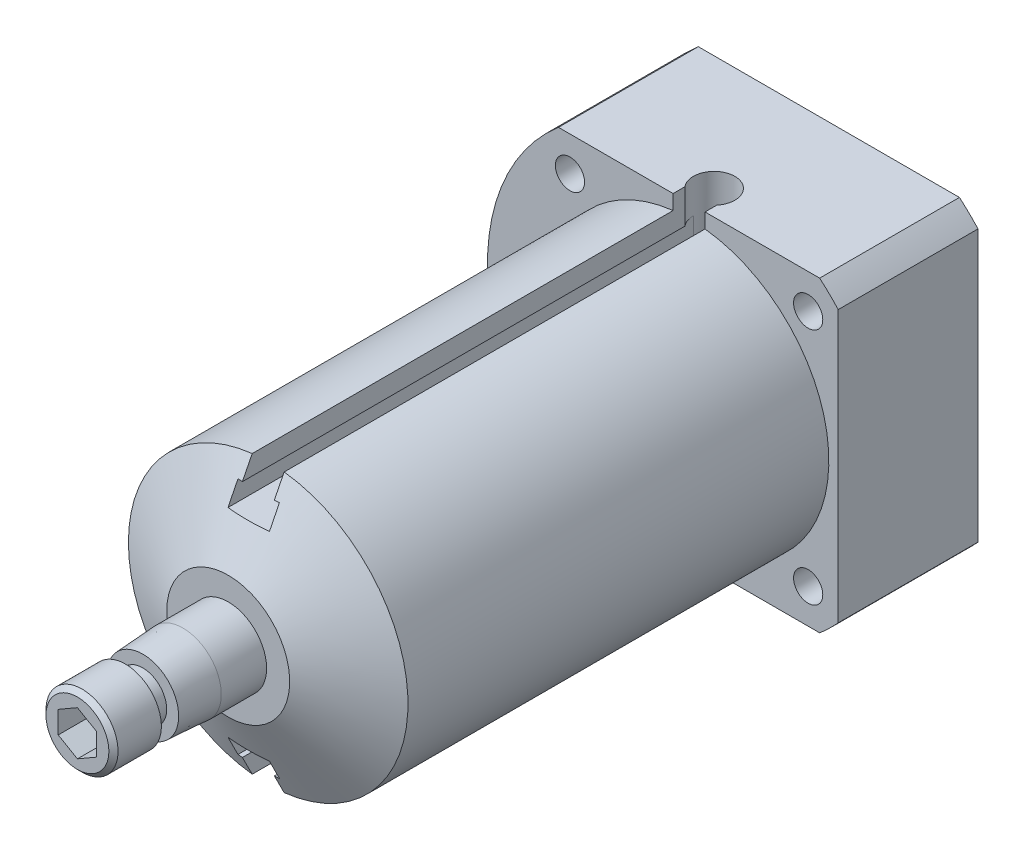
ISO-10303-21;
HEADER;
FILE_DESCRIPTION(('STEP AP214'),'2;1');
FILE_NAME('part.step','',(''),(''),'','','');
FILE_SCHEMA(('AUTOMOTIVE_DESIGN { 1 0 10303 214 1 1 1 1 }'));
ENDSEC;
DATA;
#1=APPLICATION_CONTEXT('core data for automotive mechanical design processes');
#2=APPLICATION_PROTOCOL_DEFINITION('international standard','automotive_design',2000,#1);
#3=PRODUCT_CONTEXT('',#1,'mechanical');
#4=PRODUCT('Part','Part','',(#3));
#5=PRODUCT_RELATED_PRODUCT_CATEGORY('part','',(#4));
#6=PRODUCT_DEFINITION_FORMATION('','',#4);
#7=PRODUCT_DEFINITION_CONTEXT('part definition',#1,'design');
#8=PRODUCT_DEFINITION('design','',#6,#7);
#9=PRODUCT_DEFINITION_SHAPE('','',#8);
#10=(LENGTH_UNIT() NAMED_UNIT(*) SI_UNIT(.MILLI.,.METRE.));
#11=(NAMED_UNIT(*) PLANE_ANGLE_UNIT() SI_UNIT($,.RADIAN.));
#12=(NAMED_UNIT(*) SI_UNIT($,.STERADIAN.) SOLID_ANGLE_UNIT());
#13=UNCERTAINTY_MEASURE_WITH_UNIT(LENGTH_MEASURE(1.E-05),#10,'distance_accuracy_value','');
#14=(GEOMETRIC_REPRESENTATION_CONTEXT(3) GLOBAL_UNCERTAINTY_ASSIGNED_CONTEXT((#13)) GLOBAL_UNIT_ASSIGNED_CONTEXT((#10,
#11,#12)) REPRESENTATION_CONTEXT('',''));
#15=CARTESIAN_POINT('',(0.,0.,0.));
#16=DIRECTION('',(0.,0.,1.));
#17=DIRECTION('',(1.,0.,0.));
#18=AXIS2_PLACEMENT_3D('',#15,#16,#17);
#19=CARTESIAN_POINT('',(0.,0.,99.314));
#20=DIRECTION('',(0.,0.,-1.));
#21=DIRECTION('',(-1.,0.,0.));
#22=AXIS2_PLACEMENT_3D('',#19,#20,#21);
#23=CYLINDRICAL_SURFACE('',#22,33.3375);
#24=CARTESIAN_POINT('',(-28.2167819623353,17.753932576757,14.2748));
#25=CARTESIAN_POINT('',(-28.2167891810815,17.7539250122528,14.0417984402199));
#26=CARTESIAN_POINT('',(-28.2273271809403,17.737206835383,13.808651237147));
#27=CARTESIAN_POINT('',(-28.2690119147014,17.6706919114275,13.3488453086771));
#28=CARTESIAN_POINT('',(-28.3001801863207,17.6208605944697,13.12219362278));
#29=CARTESIAN_POINT('',(-28.3816381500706,17.4893529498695,12.6821025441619));
#30=CARTESIAN_POINT('',(-28.4319148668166,17.4076982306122,12.4686542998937));
#31=CARTESIAN_POINT('',(-28.5492923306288,17.2145150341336,12.0608117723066));
#32=CARTESIAN_POINT('',(-28.6163902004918,17.1029916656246,11.8664142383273));
#33=CARTESIAN_POINT('',(-28.7648656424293,16.8520831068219,11.5010644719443));
#34=CARTESIAN_POINT('',(-28.8463128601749,16.7125615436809,11.3302341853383));
#35=CARTESIAN_POINT('',(-29.0198565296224,16.4093657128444,11.0179215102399));
#36=CARTESIAN_POINT('',(-29.1119535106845,16.2456902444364,10.8764405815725));
#37=CARTESIAN_POINT('',(-29.3034650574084,15.8976527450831,10.6264054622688));
#38=CARTESIAN_POINT('',(-29.4029027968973,15.7132241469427,10.517961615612));
#39=CARTESIAN_POINT('',(-29.6050841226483,15.3288940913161,10.3377857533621));
#40=CARTESIAN_POINT('',(-29.7078275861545,15.1289932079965,10.2660523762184));
#41=CARTESIAN_POINT('',(-29.9124821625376,14.7201992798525,10.1616979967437));
#42=CARTESIAN_POINT('',(-30.0143948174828,14.5113587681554,10.1288742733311));
#43=CARTESIAN_POINT('',(-30.2146946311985,14.0895574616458,10.1026426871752));
#44=CARTESIAN_POINT('',(-30.3130819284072,13.8765968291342,10.1092332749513));
#45=CARTESIAN_POINT('',(-30.5030361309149,13.4538881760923,10.1614807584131));
#46=CARTESIAN_POINT('',(-30.5946380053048,13.2441288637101,10.2069196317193));
#47=CARTESIAN_POINT('',(-30.7694645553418,12.8327294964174,10.3352330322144));
#48=CARTESIAN_POINT('',(-30.8526890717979,12.6310895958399,10.4181082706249));
#49=CARTESIAN_POINT('',(-31.0093867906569,12.2413689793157,10.6191737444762));
#50=CARTESIAN_POINT('',(-31.0828331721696,12.0533261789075,10.737458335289));
#51=CARTESIAN_POINT('',(-31.2186556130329,11.6970447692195,11.0059162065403));
#52=CARTESIAN_POINT('',(-31.2810311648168,11.5288070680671,11.1560909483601));
#53=CARTESIAN_POINT('',(-31.394479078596,11.2162153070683,11.4852873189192));
#54=CARTESIAN_POINT('',(-31.4454713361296,11.0720322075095,11.6644989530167));
#55=CARTESIAN_POINT('',(-31.5352989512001,10.8135383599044,12.0460292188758));
#56=CARTESIAN_POINT('',(-31.5741342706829,10.6992277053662,12.2483479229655));
#57=CARTESIAN_POINT('',(-31.6395585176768,10.5041840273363,12.6705174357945));
#58=CARTESIAN_POINT('',(-31.6661422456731,10.4234652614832,12.8903756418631));
#59=CARTESIAN_POINT('',(-31.7070315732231,10.2984184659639,13.3412958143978));
#60=CARTESIAN_POINT('',(-31.7213377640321,10.2540886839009,13.5723572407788));
#61=CARTESIAN_POINT('',(-31.7376377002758,10.2035274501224,14.0374574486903));
#62=CARTESIAN_POINT('',(-31.7397137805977,10.197041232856,14.2714656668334));
#63=CARTESIAN_POINT('',(-31.7317777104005,10.22170978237,14.7372781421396));
#64=CARTESIAN_POINT('',(-31.7217658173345,10.252863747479,14.9690824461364));
#65=CARTESIAN_POINT('',(-31.689692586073,10.3515670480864,15.4231108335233));
#66=CARTESIAN_POINT('',(-31.6676719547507,10.4189934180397,15.645364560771));
#67=CARTESIAN_POINT('',(-31.6115989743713,10.5878982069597,16.0749102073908));
#68=CARTESIAN_POINT('',(-31.5775462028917,10.6893778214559,16.2822016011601));
#69=CARTESIAN_POINT('',(-31.4972526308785,10.9237056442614,16.6771404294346));
#70=CARTESIAN_POINT('',(-31.4509484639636,11.056716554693,16.8646784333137));
#71=CARTESIAN_POINT('',(-31.346449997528,11.3495854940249,17.2136704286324));
#72=CARTESIAN_POINT('',(-31.288255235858,11.5094445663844,17.3751234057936));
#73=CARTESIAN_POINT('',(-31.1600971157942,11.8520389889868,17.6682955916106));
#74=CARTESIAN_POINT('',(-31.0900686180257,12.0348994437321,17.7998402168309));
#75=CARTESIAN_POINT('',(-30.9393817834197,12.4171538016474,18.0282536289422));
#76=CARTESIAN_POINT('',(-30.8587236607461,12.6165473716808,18.1251231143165));
#77=CARTESIAN_POINT('',(-30.6884345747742,13.0252727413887,18.2811481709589));
#78=CARTESIAN_POINT('',(-30.5988283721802,13.2345763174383,18.3404046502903));
#79=CARTESIAN_POINT('',(-30.412471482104,13.6573725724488,18.4198498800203));
#80=CARTESIAN_POINT('',(-30.315721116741,13.8708650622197,18.4400403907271));
#81=CARTESIAN_POINT('',(-30.1183477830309,14.2943429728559,18.4407476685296));
#82=CARTESIAN_POINT('',(-30.0177556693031,14.5043423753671,18.4215336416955));
#83=CARTESIAN_POINT('',(-29.8151293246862,14.9164240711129,18.3445474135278));
#84=CARTESIAN_POINT('',(-29.7130950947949,15.1185063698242,18.2867752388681));
#85=CARTESIAN_POINT('',(-29.5110307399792,15.5092350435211,18.1343971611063));
#86=CARTESIAN_POINT('',(-29.4109999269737,15.6978860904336,18.0398041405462));
#87=CARTESIAN_POINT('',(-29.2165050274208,16.0569763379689,17.8164974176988));
#88=CARTESIAN_POINT('',(-29.1220410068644,16.2274153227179,17.6877833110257));
#89=CARTESIAN_POINT('',(-28.9417042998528,16.5469207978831,17.3988921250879));
#90=CARTESIAN_POINT('',(-28.8558918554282,16.6958401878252,17.2385147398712));
#91=CARTESIAN_POINT('',(-28.6970645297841,16.9673865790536,16.8912654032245));
#92=CARTESIAN_POINT('',(-28.6240526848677,17.0900073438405,16.7043871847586));
#93=CARTESIAN_POINT('',(-28.49375094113,17.3063897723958,16.3086141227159));
#94=CARTESIAN_POINT('',(-28.4365227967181,17.4000382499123,16.0996371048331));
#95=CARTESIAN_POINT('',(-28.3408251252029,17.5554818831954,15.666297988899));
#96=CARTESIAN_POINT('',(-28.3023351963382,17.6173116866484,15.4419529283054));
#97=CARTESIAN_POINT('',(-28.2551219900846,17.6928856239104,15.059505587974));
#98=CARTESIAN_POINT('',(-28.2407759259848,17.7157503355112,14.9038156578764));
#99=CARTESIAN_POINT('',(-28.2216035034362,17.7462763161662,14.5903727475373));
#100=CARTESIAN_POINT('',(-28.216777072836,17.7539377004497,14.4326197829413));
#101=CARTESIAN_POINT('',(-28.2167819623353,17.753932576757,14.2748));
#102=B_SPLINE_CURVE_WITH_KNOTS('',3,(#24,#25,#26,#27,#28,#29,#30,#31,#32,#33,#34,#35,#36,#37,
#38,#39,#40,#41,#42,#43,#44,#45,#46,#47,#48,#49,#50,#51,#52,#53,#54,#55,#56,#57,#58,#59,#60,#61,
#62,#63,#64,#65,#66,#67,#68,#69,#70,#71,#72,#73,#74,#75,#76,#77,#78,#79,#80,#81,#82,#83,#84,#85,
#86,#87,#88,#89,#90,#91,#92,#93,#94,#95,#96,#97,#98,#99,#100,#101),.UNSPECIFIED.,.T.,.F.,(4,2,2,
2,2,2,2,2,2,2,2,2,2,2,2,2,2,2,2,2,2,2,2,2,2,2,2,2,2,2,2,2,2,2,2,2,2,2,4),(0.,0.698428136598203,
1.39758657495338,2.09627110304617,2.79483620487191,3.49689026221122,4.19897923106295,
4.90338810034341,5.60777084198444,6.3084673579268,7.00913632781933,7.7058986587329,
8.40267422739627,9.10132327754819,9.80000435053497,10.503457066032,11.2069119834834,
11.9106651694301,12.6143844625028,13.3133607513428,14.0123221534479,14.7089288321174,
15.405559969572,16.1058671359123,16.8062015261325,17.5105246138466,18.2148335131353,
18.9172448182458,19.6196244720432,20.3172215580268,21.0148181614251,21.7121709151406,
22.4095319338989,23.1114547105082,23.8135437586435,24.5183420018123,25.2223711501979,
25.6954435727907,26.1685124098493),.UNSPECIFIED.);
#103=CARTESIAN_POINT('',(-28.2167819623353,17.753932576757,14.2748));
#104=VERTEX_POINT('',#103);
#105=EDGE_CURVE('E517',#104,#104,#102,.T.);
#106=ORIENTED_EDGE('',*,*,#105,.F.);
#107=EDGE_LOOP('',(#106));
#108=FACE_BOUND('',#107,.T.);
#109=DIRECTION('',(0.,0.,-1.));
#110=VECTOR('',#109,1.);
#111=CARTESIAN_POINT('',(-21.5923344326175,-25.4,99.314));
#112=LINE('',#111,#110);
#113=CARTESIAN_POINT('',(-21.5923344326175,-25.4,23.114));
#114=VERTEX_POINT('',#113);
#115=CARTESIAN_POINT('',(-21.5923344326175,-25.4,0.));
#116=VERTEX_POINT('',#115);
#117=EDGE_CURVE('E584',#114,#116,#112,.T.);
#118=ORIENTED_EDGE('',*,*,#117,.F.);
#119=CARTESIAN_POINT('',(0.,0.,23.114));
#120=DIRECTION('',(0.,0.,-1.));
#121=DIRECTION('',(-1.,0.,0.));
#122=AXIS2_PLACEMENT_3D('',#119,#120,#121);
#123=CIRCLE('',#122,33.3375);
#124=CARTESIAN_POINT('',(-21.5923344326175,25.4,23.114));
#125=VERTEX_POINT('',#124);
#126=EDGE_CURVE('E587',#114,#125,#123,.T.);
#127=ORIENTED_EDGE('',*,*,#126,.T.);
#128=DIRECTION('',(0.,0.,-1.));
#129=VECTOR('',#128,1.);
#130=CARTESIAN_POINT('',(-21.5923344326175,25.4,99.314));
#131=LINE('',#130,#129);
#132=CARTESIAN_POINT('',(-21.5923344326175,25.4,0.));
#133=VERTEX_POINT('',#132);
#134=EDGE_CURVE('E753',#125,#133,#131,.T.);
#135=ORIENTED_EDGE('',*,*,#134,.T.);
#136=CARTESIAN_POINT('',(0.,0.,0.));
#137=DIRECTION('',(0.,0.,1.));
#138=DIRECTION('',(1.,0.,0.));
#139=AXIS2_PLACEMENT_3D('',#136,#137,#138);
#140=CIRCLE('',#139,33.3375);
#141=EDGE_CURVE('E590',#133,#116,#140,.T.);
#142=ORIENTED_EDGE('',*,*,#141,.T.);
#143=EDGE_LOOP('',(#118,#127,#135,#142));
#144=FACE_BOUND('',#143,.T.);
#145=CARTESIAN_POINT('',(-28.2167819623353,-17.753932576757,14.2748));
#146=CARTESIAN_POINT('',(-28.2167891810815,-17.7539250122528,14.5078015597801));
#147=CARTESIAN_POINT('',(-28.2273271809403,-17.737206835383,14.740948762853));
#148=CARTESIAN_POINT('',(-28.2690119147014,-17.6706919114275,15.2007546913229));
#149=CARTESIAN_POINT('',(-28.3001801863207,-17.6208605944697,15.42740637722));
#150=CARTESIAN_POINT('',(-28.3816381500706,-17.4893529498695,15.8674974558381));
#151=CARTESIAN_POINT('',(-28.4319148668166,-17.4076982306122,16.0809457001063));
#152=CARTESIAN_POINT('',(-28.5492923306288,-17.2145150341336,16.4887882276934));
#153=CARTESIAN_POINT('',(-28.6163902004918,-17.1029916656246,16.6831857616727));
#154=CARTESIAN_POINT('',(-28.7648656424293,-16.8520831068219,17.0485355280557));
#155=CARTESIAN_POINT('',(-28.8463128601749,-16.7125615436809,17.2193658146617));
#156=CARTESIAN_POINT('',(-29.0198565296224,-16.4093657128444,17.5316784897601));
#157=CARTESIAN_POINT('',(-29.1119535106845,-16.2456902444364,17.6731594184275));
#158=CARTESIAN_POINT('',(-29.3034650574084,-15.8976527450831,17.9231945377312));
#159=CARTESIAN_POINT('',(-29.4029027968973,-15.7132241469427,18.031638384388));
#160=CARTESIAN_POINT('',(-29.6050841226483,-15.3288940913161,18.2118142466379));
#161=CARTESIAN_POINT('',(-29.7078275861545,-15.1289932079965,18.2835476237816));
#162=CARTESIAN_POINT('',(-29.9124821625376,-14.7201992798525,18.3879020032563));
#163=CARTESIAN_POINT('',(-30.0143948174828,-14.5113587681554,18.4207257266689));
#164=CARTESIAN_POINT('',(-30.2146946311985,-14.0895574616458,18.4469573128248));
#165=CARTESIAN_POINT('',(-30.3130819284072,-13.8765968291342,18.4403667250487));
#166=CARTESIAN_POINT('',(-30.5030361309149,-13.4538881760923,18.3881192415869));
#167=CARTESIAN_POINT('',(-30.5946380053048,-13.2441288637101,18.3426803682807));
#168=CARTESIAN_POINT('',(-30.7694645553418,-12.8327294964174,18.2143669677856));
#169=CARTESIAN_POINT('',(-30.8526890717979,-12.6310895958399,18.1314917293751));
#170=CARTESIAN_POINT('',(-31.0093867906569,-12.2413689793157,17.9304262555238));
#171=CARTESIAN_POINT('',(-31.0828331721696,-12.0533261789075,17.812141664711));
#172=CARTESIAN_POINT('',(-31.2186556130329,-11.6970447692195,17.5436837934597));
#173=CARTESIAN_POINT('',(-31.2810311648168,-11.5288070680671,17.3935090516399));
#174=CARTESIAN_POINT('',(-31.394479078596,-11.2162153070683,17.0643126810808));
#175=CARTESIAN_POINT('',(-31.4454713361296,-11.0720322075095,16.8851010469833));
#176=CARTESIAN_POINT('',(-31.5352989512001,-10.8135383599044,16.5035707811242));
#177=CARTESIAN_POINT('',(-31.5741342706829,-10.6992277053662,16.3012520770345));
#178=CARTESIAN_POINT('',(-31.6395585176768,-10.5041840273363,15.8790825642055));
#179=CARTESIAN_POINT('',(-31.6661422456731,-10.4234652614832,15.6592243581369));
#180=CARTESIAN_POINT('',(-31.7070315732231,-10.2984184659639,15.2083041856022));
#181=CARTESIAN_POINT('',(-31.7213377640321,-10.2540886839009,14.9772427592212));
#182=CARTESIAN_POINT('',(-31.7376377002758,-10.2035274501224,14.5121425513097));
#183=CARTESIAN_POINT('',(-31.7397137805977,-10.197041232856,14.2781343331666));
#184=CARTESIAN_POINT('',(-31.7317777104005,-10.22170978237,13.8123218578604));
#185=CARTESIAN_POINT('',(-31.7217658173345,-10.252863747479,13.5805175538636));
#186=CARTESIAN_POINT('',(-31.689692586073,-10.3515670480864,13.1264891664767));
#187=CARTESIAN_POINT('',(-31.6676719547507,-10.4189934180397,12.904235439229));
#188=CARTESIAN_POINT('',(-31.6115989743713,-10.5878982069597,12.4746897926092));
#189=CARTESIAN_POINT('',(-31.5775462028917,-10.6893778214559,12.2673983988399));
#190=CARTESIAN_POINT('',(-31.4972526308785,-10.9237056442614,11.8724595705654));
#191=CARTESIAN_POINT('',(-31.4509484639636,-11.056716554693,11.6849215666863));
#192=CARTESIAN_POINT('',(-31.346449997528,-11.3495854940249,11.3359295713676));
#193=CARTESIAN_POINT('',(-31.288255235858,-11.5094445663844,11.1744765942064));
#194=CARTESIAN_POINT('',(-31.1600971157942,-11.8520389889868,10.8813044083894));
#195=CARTESIAN_POINT('',(-31.0900686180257,-12.0348994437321,10.7497597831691));
#196=CARTESIAN_POINT('',(-30.9393817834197,-12.4171538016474,10.5213463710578));
#197=CARTESIAN_POINT('',(-30.8587236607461,-12.6165473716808,10.4244768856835));
#198=CARTESIAN_POINT('',(-30.6884345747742,-13.0252727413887,10.2684518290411));
#199=CARTESIAN_POINT('',(-30.5988283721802,-13.2345763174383,10.2091953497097));
#200=CARTESIAN_POINT('',(-30.412471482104,-13.6573725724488,10.1297501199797));
#201=CARTESIAN_POINT('',(-30.315721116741,-13.8708650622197,10.1095596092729));
#202=CARTESIAN_POINT('',(-30.1183477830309,-14.2943429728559,10.1088523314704));
#203=CARTESIAN_POINT('',(-30.0177556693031,-14.5043423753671,10.1280663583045));
#204=CARTESIAN_POINT('',(-29.8151293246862,-14.9164240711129,10.2050525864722));
#205=CARTESIAN_POINT('',(-29.7130950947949,-15.1185063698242,10.2628247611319));
#206=CARTESIAN_POINT('',(-29.5110307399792,-15.5092350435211,10.4152028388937));
#207=CARTESIAN_POINT('',(-29.4109999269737,-15.6978860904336,10.5097958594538));
#208=CARTESIAN_POINT('',(-29.2165050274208,-16.0569763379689,10.7331025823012));
#209=CARTESIAN_POINT('',(-29.1220410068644,-16.2274153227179,10.8618166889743));
#210=CARTESIAN_POINT('',(-28.9417042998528,-16.5469207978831,11.1507078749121));
#211=CARTESIAN_POINT('',(-28.8558918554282,-16.6958401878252,11.3110852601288));
#212=CARTESIAN_POINT('',(-28.6970645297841,-16.9673865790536,11.6583345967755));
#213=CARTESIAN_POINT('',(-28.6240526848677,-17.0900073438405,11.8452128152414));
#214=CARTESIAN_POINT('',(-28.49375094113,-17.3063897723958,12.2409858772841));
#215=CARTESIAN_POINT('',(-28.4365227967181,-17.4000382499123,12.4499628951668));
#216=CARTESIAN_POINT('',(-28.3408251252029,-17.5554818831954,12.883302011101));
#217=CARTESIAN_POINT('',(-28.3023351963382,-17.6173116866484,13.1076470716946));
#218=CARTESIAN_POINT('',(-28.2551219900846,-17.6928856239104,13.490094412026));
#219=CARTESIAN_POINT('',(-28.2407759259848,-17.7157503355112,13.6457843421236));
#220=CARTESIAN_POINT('',(-28.2216035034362,-17.7462763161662,13.9592272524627));
#221=CARTESIAN_POINT('',(-28.216777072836,-17.7539377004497,14.1169802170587));
#222=CARTESIAN_POINT('',(-28.2167819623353,-17.753932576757,14.2748));
#223=B_SPLINE_CURVE_WITH_KNOTS('',3,(#145,#146,#147,#148,#149,#150,#151,#152,#153,#154,#155,
#156,#157,#158,#159,#160,#161,#162,#163,#164,#165,#166,#167,#168,#169,#170,#171,#172,#173,#174,
#175,#176,#177,#178,#179,#180,#181,#182,#183,#184,#185,#186,#187,#188,#189,#190,#191,#192,#193,
#194,#195,#196,#197,#198,#199,#200,#201,#202,#203,#204,#205,#206,#207,#208,#209,#210,#211,#212,
#213,#214,#215,#216,#217,#218,#219,#220,#221,#222),.UNSPECIFIED.,.T.,.F.,(4,2,2,2,2,2,2,2,2,2,2,
2,2,2,2,2,2,2,2,2,2,2,2,2,2,2,2,2,2,2,2,2,2,2,2,2,2,2,4),(0.,0.698428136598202,1.39758657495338,
2.09627110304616,2.79483620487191,3.49689026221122,4.19897923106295,4.90338810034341,
5.60777084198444,6.3084673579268,7.00913632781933,7.7058986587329,8.40267422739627,
9.10132327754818,9.80000435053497,10.503457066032,11.2069119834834,11.9106651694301,
12.6143844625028,13.3133607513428,14.0123221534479,14.7089288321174,15.405559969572,
16.1058671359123,16.8062015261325,17.5105246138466,18.2148335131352,18.9172448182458,
19.6196244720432,20.3172215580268,21.0148181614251,21.7121709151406,22.4095319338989,
23.1114547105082,23.8135437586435,24.5183420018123,25.2223711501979,25.6954435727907,
26.1685124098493),.UNSPECIFIED.);
#224=CARTESIAN_POINT('',(-28.2167819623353,-17.753932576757,14.2748));
#225=VERTEX_POINT('',#224);
#226=EDGE_CURVE('E510',#225,#225,#223,.T.);
#227=ORIENTED_EDGE('',*,*,#226,.F.);
#228=EDGE_LOOP('',(#227));
#229=FACE_BOUND('',#228,.T.);
#230=ADVANCED_FACE('F36',(#108,#144,#229),#23,.T.);
#231=CARTESIAN_POINT('',(-33.3375,0.,23.114));
#232=DIRECTION('',(0.,0.,-1.));
#233=DIRECTION('',(-1.,0.,0.));
#234=AXIS2_PLACEMENT_3D('',#231,#232,#233);
#235=PLANE('',#234);
#236=CARTESIAN_POINT('',(-19.6937016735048,-19.6937016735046,23.114));
#237=DIRECTION('',(0.,0.,1.));
#238=DIRECTION('',(1.,0.,0.));
#239=AXIS2_PLACEMENT_3D('',#236,#237,#238);
#240=CIRCLE('',#239,2.41300000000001);
#241=CARTESIAN_POINT('',(-17.2807016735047,-19.6937016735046,23.114));
#242=VERTEX_POINT('',#241);
#243=EDGE_CURVE('E694',#242,#242,#240,.T.);
#244=ORIENTED_EDGE('',*,*,#243,.F.);
#245=EDGE_LOOP('',(#244));
#246=FACE_BOUND('',#245,.T.);
#247=CARTESIAN_POINT('',(19.6937016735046,19.6937016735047,23.114));
#248=DIRECTION('',(0.,0.,1.));
#249=DIRECTION('',(1.,0.,0.));
#250=AXIS2_PLACEMENT_3D('',#247,#248,#249);
#251=CIRCLE('',#250,2.41300000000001);
#252=CARTESIAN_POINT('',(22.1067016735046,19.6937016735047,23.114));
#253=VERTEX_POINT('',#252);
#254=EDGE_CURVE('E706',#253,#253,#251,.T.);
#255=ORIENTED_EDGE('',*,*,#254,.F.);
#256=EDGE_LOOP('',(#255));
#257=FACE_BOUND('',#256,.T.);
#258=DIRECTION('',(1.,0.,0.));
#259=VECTOR('',#258,1.);
#260=CARTESIAN_POINT('',(-21.5923344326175,25.4,23.114));
#261=LINE('',#260,#259);
#262=CARTESIAN_POINT('',(2.6416,25.4,23.114));
#263=VERTEX_POINT('',#262);
#264=CARTESIAN_POINT('',(21.5923344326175,25.4,23.114));
#265=VERTEX_POINT('',#264);
#266=EDGE_CURVE('E595',#263,#265,#261,.T.);
#267=ORIENTED_EDGE('',*,*,#266,.F.);
#268=DIRECTION('',(0.,-1.,0.));
#269=VECTOR('',#268,1.);
#270=CARTESIAN_POINT('',(2.64159999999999,0.,23.114));
#271=LINE('',#270,#269);
#272=CARTESIAN_POINT('',(2.6416,22.9625552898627,23.114));
#273=VERTEX_POINT('',#272);
#274=EDGE_CURVE('E680',#263,#273,#271,.T.);
#275=ORIENTED_EDGE('',*,*,#274,.T.);
#276=CARTESIAN_POINT('',(0.,0.,23.114));
#277=DIRECTION('',(0.,0.,-1.));
#278=DIRECTION('',(-1.,0.,0.));
#279=AXIS2_PLACEMENT_3D('',#276,#277,#278);
#280=CIRCLE('',#279,23.114);
#281=CARTESIAN_POINT('',(-2.6416,22.9625552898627,23.114));
#282=VERTEX_POINT('',#281);
#283=EDGE_CURVE('E727',#273,#282,#280,.T.);
#284=ORIENTED_EDGE('',*,*,#283,.T.);
#285=DIRECTION('',(0.,1.,0.));
#286=VECTOR('',#285,1.);
#287=CARTESIAN_POINT('',(-2.64159999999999,0.,23.114));
#288=LINE('',#287,#286);
#289=CARTESIAN_POINT('',(-2.6416,25.4,23.114));
#290=VERTEX_POINT('',#289);
#291=EDGE_CURVE('E672',#282,#290,#288,.T.);
#292=ORIENTED_EDGE('',*,*,#291,.T.);
#293=EDGE_CURVE('E598',#125,#290,#261,.T.);
#294=ORIENTED_EDGE('',*,*,#293,.F.);
#295=ORIENTED_EDGE('',*,*,#126,.F.);
#296=DIRECTION('',(-1.,0.,0.));
#297=VECTOR('',#296,1.);
#298=CARTESIAN_POINT('',(-21.5923344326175,-25.4,23.114));
#299=LINE('',#298,#297);
#300=CARTESIAN_POINT('',(21.5923344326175,-25.4,23.114));
#301=VERTEX_POINT('',#300);
#302=EDGE_CURVE('E736',#301,#114,#299,.T.);
#303=ORIENTED_EDGE('',*,*,#302,.F.);
#304=CARTESIAN_POINT('',(24.6634,-22.4300157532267,23.114));
#305=VERTEX_POINT('',#304);
#306=EDGE_CURVE('E731',#305,#301,#123,.T.);
#307=ORIENTED_EDGE('',*,*,#306,.F.);
#308=DIRECTION('',(0.,-1.,0.));
#309=VECTOR('',#308,1.);
#310=CARTESIAN_POINT('',(24.6634,22.4300157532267,23.114));
#311=LINE('',#310,#309);
#312=CARTESIAN_POINT('',(24.6634,22.4300157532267,23.114));
#313=VERTEX_POINT('',#312);
#314=EDGE_CURVE('E733',#313,#305,#311,.T.);
#315=ORIENTED_EDGE('',*,*,#314,.F.);
#316=EDGE_CURVE('E732',#265,#313,#123,.T.);
#317=ORIENTED_EDGE('',*,*,#316,.F.);
#318=EDGE_LOOP('',(#267,#275,#284,#292,#294,#295,#303,#307,#315,#317));
#319=FACE_BOUND('',#318,.T.);
#320=CARTESIAN_POINT('',(19.6937016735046,-19.6937016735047,23.114));
#321=DIRECTION('',(0.,0.,1.));
#322=DIRECTION('',(1.,0.,0.));
#323=AXIS2_PLACEMENT_3D('',#320,#321,#322);
#324=CIRCLE('',#323,2.41300000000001);
#325=CARTESIAN_POINT('',(22.1067016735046,-19.6937016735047,23.114));
#326=VERTEX_POINT('',#325);
#327=EDGE_CURVE('E700',#326,#326,#324,.T.);
#328=ORIENTED_EDGE('',*,*,#327,.F.);
#329=EDGE_LOOP('',(#328));
#330=FACE_BOUND('',#329,.T.);
#331=CARTESIAN_POINT('',(-19.6937016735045,19.6937016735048,23.114));
#332=DIRECTION('',(0.,0.,1.));
#333=DIRECTION('',(1.,0.,0.));
#334=AXIS2_PLACEMENT_3D('',#331,#332,#333);
#335=CIRCLE('',#334,2.41300000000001);
#336=CARTESIAN_POINT('',(-17.2807016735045,19.6937016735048,23.114));
#337=VERTEX_POINT('',#336);
#338=EDGE_CURVE('E522',#337,#337,#335,.T.);
#339=ORIENTED_EDGE('',*,*,#338,.F.);
#340=EDGE_LOOP('',(#339));
#341=FACE_BOUND('',#340,.T.);
#342=ADVANCED_FACE('F571',(#246,#257,#319,#330,#341),#235,.F.);
#343=CARTESIAN_POINT('',(-21.5923344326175,-25.4,99.314));
#344=DIRECTION('',(0.,1.,0.));
#345=DIRECTION('',(0.,0.,1.));
#346=AXIS2_PLACEMENT_3D('',#343,#344,#345);
#347=PLANE('',#346);
#348=DIRECTION('',(0.,0.,-1.));
#349=VECTOR('',#348,1.);
#350=CARTESIAN_POINT('',(21.5923344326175,-25.4,99.314));
#351=LINE('',#350,#349);
#352=CARTESIAN_POINT('',(21.5923344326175,-25.4,0.));
#353=VERTEX_POINT('',#352);
#354=EDGE_CURVE('E596',#301,#353,#351,.T.);
#355=ORIENTED_EDGE('',*,*,#354,.F.);
#356=ORIENTED_EDGE('',*,*,#302,.T.);
#357=ORIENTED_EDGE('',*,*,#117,.T.);
#358=DIRECTION('',(1.,0.,0.));
#359=VECTOR('',#358,1.);
#360=CARTESIAN_POINT('',(-21.5923344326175,-25.4,0.));
#361=LINE('',#360,#359);
#362=EDGE_CURVE('E739',#116,#353,#361,.T.);
#363=ORIENTED_EDGE('',*,*,#362,.T.);
#364=EDGE_LOOP('',(#355,#356,#357,#363));
#365=FACE_BOUND('',#364,.T.);
#366=ADVANCED_FACE('F576',(#365),#347,.F.);
#367=CARTESIAN_POINT('',(0.,0.,99.314));
#368=DIRECTION('',(0.,0.,-1.));
#369=DIRECTION('',(-1.,0.,0.));
#370=AXIS2_PLACEMENT_3D('',#367,#368,#369);
#371=CYLINDRICAL_SURFACE('',#370,33.3375);
#372=DIRECTION('',(0.,0.,-1.));
#373=VECTOR('',#372,1.);
#374=CARTESIAN_POINT('',(24.6634,-22.4300157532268,99.314));
#375=LINE('',#374,#373);
#376=CARTESIAN_POINT('',(24.6634,-22.4300157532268,0.));
#377=VERTEX_POINT('',#376);
#378=EDGE_CURVE('E599',#305,#377,#375,.T.);
#379=ORIENTED_EDGE('',*,*,#378,.F.);
#380=ORIENTED_EDGE('',*,*,#306,.T.);
#381=ORIENTED_EDGE('',*,*,#354,.T.);
#382=CARTESIAN_POINT('',(0.,0.,0.));
#383=DIRECTION('',(0.,0.,1.));
#384=DIRECTION('',(1.,0.,0.));
#385=AXIS2_PLACEMENT_3D('',#382,#383,#384);
#386=CIRCLE('',#385,33.3375);
#387=EDGE_CURVE('E741',#353,#377,#386,.T.);
#388=ORIENTED_EDGE('',*,*,#387,.T.);
#389=EDGE_LOOP('',(#379,#380,#381,#388));
#390=FACE_BOUND('',#389,.T.);
#391=ADVANCED_FACE('F767',(#390),#371,.T.);
#392=CARTESIAN_POINT('',(24.6634,22.4300157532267,99.314));
#393=DIRECTION('',(-1.,0.,0.));
#394=DIRECTION('',(0.,0.,1.));
#395=AXIS2_PLACEMENT_3D('',#392,#393,#394);
#396=PLANE('',#395);
#397=DIRECTION('',(0.,0.,-1.));
#398=VECTOR('',#397,1.);
#399=CARTESIAN_POINT('',(24.6634,22.4300157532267,99.314));
#400=LINE('',#399,#398);
#401=CARTESIAN_POINT('',(24.6634,22.4300157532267,0.));
#402=VERTEX_POINT('',#401);
#403=EDGE_CURVE('E757',#313,#402,#400,.T.);
#404=ORIENTED_EDGE('',*,*,#403,.F.);
#405=ORIENTED_EDGE('',*,*,#314,.T.);
#406=ORIENTED_EDGE('',*,*,#378,.T.);
#407=DIRECTION('',(0.,1.,0.));
#408=VECTOR('',#407,1.);
#409=CARTESIAN_POINT('',(24.6634,22.4300157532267,0.));
#410=LINE('',#409,#408);
#411=EDGE_CURVE('E744',#377,#402,#410,.T.);
#412=ORIENTED_EDGE('',*,*,#411,.T.);
#413=EDGE_LOOP('',(#404,#405,#406,#412));
#414=FACE_BOUND('',#413,.T.);
#415=ADVANCED_FACE('F761',(#414),#396,.F.);
#416=CARTESIAN_POINT('',(0.,0.,99.314));
#417=DIRECTION('',(0.,0.,-1.));
#418=DIRECTION('',(-1.,0.,0.));
#419=AXIS2_PLACEMENT_3D('',#416,#417,#418);
#420=CYLINDRICAL_SURFACE('',#419,33.3375);
#421=DIRECTION('',(0.,0.,-1.));
#422=VECTOR('',#421,1.);
#423=CARTESIAN_POINT('',(21.5923344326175,25.4,99.314));
#424=LINE('',#423,#422);
#425=CARTESIAN_POINT('',(21.5923344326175,25.4,0.));
#426=VERTEX_POINT('',#425);
#427=EDGE_CURVE('E755',#265,#426,#424,.T.);
#428=ORIENTED_EDGE('',*,*,#427,.F.);
#429=ORIENTED_EDGE('',*,*,#316,.T.);
#430=ORIENTED_EDGE('',*,*,#403,.T.);
#431=CARTESIAN_POINT('',(0.,0.,0.));
#432=DIRECTION('',(0.,0.,1.));
#433=DIRECTION('',(1.,0.,0.));
#434=AXIS2_PLACEMENT_3D('',#431,#432,#433);
#435=CIRCLE('',#434,33.3375);
#436=EDGE_CURVE('E747',#402,#426,#435,.T.);
#437=ORIENTED_EDGE('',*,*,#436,.T.);
#438=EDGE_LOOP('',(#428,#429,#430,#437));
#439=FACE_BOUND('',#438,.T.);
#440=ADVANCED_FACE('F774',(#439),#420,.T.);
#441=CARTESIAN_POINT('',(-21.5923344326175,25.4,99.314));
#442=DIRECTION('',(0.,-1.,0.));
#443=DIRECTION('',(0.,0.,-1.));
#444=AXIS2_PLACEMENT_3D('',#441,#442,#443);
#445=PLANE('',#444);
#446=DIRECTION('',(0.,0.,-1.));
#447=VECTOR('',#446,1.);
#448=CARTESIAN_POINT('',(-2.6416,25.4,99.314));
#449=LINE('',#448,#447);
#450=CARTESIAN_POINT('',(-2.6416,25.4,21.1601189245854));
#451=VERTEX_POINT('',#450);
#452=EDGE_CURVE('E675',#290,#451,#449,.T.);
#453=ORIENTED_EDGE('',*,*,#452,.T.);
#454=CARTESIAN_POINT('',(0.,25.4,18.9738));
#455=DIRECTION('',(0.,1.,0.));
#456=DIRECTION('',(0.,0.,1.));
#457=AXIS2_PLACEMENT_3D('',#454,#455,#456);
#458=CIRCLE('',#457,3.429);
#459=CARTESIAN_POINT('',(2.64159999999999,25.4,21.1601189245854));
#460=VERTEX_POINT('',#459);
#461=EDGE_CURVE('E60',#460,#451,#458,.T.);
#462=ORIENTED_EDGE('',*,*,#461,.F.);
#463=DIRECTION('',(0.,0.,1.));
#464=VECTOR('',#463,1.);
#465=CARTESIAN_POINT('',(2.6416,25.4,99.314));
#466=LINE('',#465,#464);
#467=EDGE_CURVE('E683',#460,#263,#466,.T.);
#468=ORIENTED_EDGE('',*,*,#467,.T.);
#469=ORIENTED_EDGE('',*,*,#266,.T.);
#470=ORIENTED_EDGE('',*,*,#427,.T.);
#471=DIRECTION('',(-1.,0.,0.));
#472=VECTOR('',#471,1.);
#473=CARTESIAN_POINT('',(-21.5923344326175,25.4,0.));
#474=LINE('',#473,#472);
#475=EDGE_CURVE('E750',#426,#133,#474,.T.);
#476=ORIENTED_EDGE('',*,*,#475,.T.);
#477=ORIENTED_EDGE('',*,*,#134,.F.);
#478=ORIENTED_EDGE('',*,*,#293,.T.);
#479=EDGE_LOOP('',(#453,#462,#468,#469,#470,#476,#477,#478));
#480=FACE_BOUND('',#479,.T.);
#481=ADVANCED_FACE('F824',(#480),#445,.F.);
#482=CARTESIAN_POINT('',(0.,0.,0.));
#483=DIRECTION('',(0.,0.,1.));
#484=DIRECTION('',(1.,0.,0.));
#485=AXIS2_PLACEMENT_3D('',#482,#483,#484);
#486=PLANE('',#485);
#487=CARTESIAN_POINT('',(-19.6937016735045,19.6937016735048,0.));
#488=DIRECTION('',(0.,0.,1.));
#489=DIRECTION('',(1.,0.,0.));
#490=AXIS2_PLACEMENT_3D('',#487,#488,#489);
#491=CIRCLE('',#490,2.41300000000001);
#492=CARTESIAN_POINT('',(-17.2807016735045,19.6937016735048,0.));
#493=VERTEX_POINT('',#492);
#494=EDGE_CURVE('E691',#493,#493,#491,.T.);
#495=ORIENTED_EDGE('',*,*,#494,.T.);
#496=EDGE_LOOP('',(#495));
#497=FACE_BOUND('',#496,.T.);
#498=CARTESIAN_POINT('',(-19.6937016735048,-19.6937016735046,0.));
#499=DIRECTION('',(0.,0.,1.));
#500=DIRECTION('',(1.,0.,0.));
#501=AXIS2_PLACEMENT_3D('',#498,#499,#500);
#502=CIRCLE('',#501,2.41300000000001);
#503=CARTESIAN_POINT('',(-17.2807016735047,-19.6937016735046,0.));
#504=VERTEX_POINT('',#503);
#505=EDGE_CURVE('E697',#504,#504,#502,.T.);
#506=ORIENTED_EDGE('',*,*,#505,.T.);
#507=EDGE_LOOP('',(#506));
#508=FACE_BOUND('',#507,.T.);
#509=CARTESIAN_POINT('',(19.6937016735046,-19.6937016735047,0.));
#510=DIRECTION('',(0.,0.,1.));
#511=DIRECTION('',(1.,0.,0.));
#512=AXIS2_PLACEMENT_3D('',#509,#510,#511);
#513=CIRCLE('',#512,2.41300000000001);
#514=CARTESIAN_POINT('',(22.1067016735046,-19.6937016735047,0.));
#515=VERTEX_POINT('',#514);
#516=EDGE_CURVE('E703',#515,#515,#513,.T.);
#517=ORIENTED_EDGE('',*,*,#516,.T.);
#518=EDGE_LOOP('',(#517));
#519=FACE_BOUND('',#518,.T.);
#520=CARTESIAN_POINT('',(19.6937016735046,19.6937016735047,0.));
#521=DIRECTION('',(0.,0.,1.));
#522=DIRECTION('',(1.,0.,0.));
#523=AXIS2_PLACEMENT_3D('',#520,#521,#522);
#524=CIRCLE('',#523,2.41300000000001);
#525=CARTESIAN_POINT('',(22.1067016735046,19.6937016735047,0.));
#526=VERTEX_POINT('',#525);
#527=EDGE_CURVE('E709',#526,#526,#524,.T.);
#528=ORIENTED_EDGE('',*,*,#527,.T.);
#529=EDGE_LOOP('',(#528));
#530=FACE_BOUND('',#529,.T.);
#531=ORIENTED_EDGE('',*,*,#141,.F.);
#532=ORIENTED_EDGE('',*,*,#475,.F.);
#533=ORIENTED_EDGE('',*,*,#436,.F.);
#534=ORIENTED_EDGE('',*,*,#411,.F.);
#535=ORIENTED_EDGE('',*,*,#387,.F.);
#536=ORIENTED_EDGE('',*,*,#362,.F.);
#537=EDGE_LOOP('',(#531,#532,#533,#534,#535,#536));
#538=FACE_BOUND('',#537,.T.);
#539=ADVANCED_FACE('F770',(#497,#508,#519,#530,#538),#486,.F.);
#540=CARTESIAN_POINT('',(0.,0.,0.));
#541=DIRECTION('',(0.,0.,-1.));
#542=DIRECTION('',(-1.,0.,0.));
#543=AXIS2_PLACEMENT_3D('',#540,#541,#542);
#544=CYLINDRICAL_SURFACE('',#543,23.114);
#545=DIRECTION('',(0.,0.,-1.));
#546=VECTOR('',#545,1.);
#547=CARTESIAN_POINT('',(2.64160000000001,-22.9625552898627,0.));
#548=LINE('',#547,#546);
#549=CARTESIAN_POINT('',(2.64160000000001,-22.9625552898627,92.71));
#550=VERTEX_POINT('',#549);
#551=CARTESIAN_POINT('',(2.64160000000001,-22.9625552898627,41.1753189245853));
#552=VERTEX_POINT('',#551);
#553=EDGE_CURVE('E645',#550,#552,#548,.T.);
#554=ORIENTED_EDGE('',*,*,#553,.T.);
#555=CARTESIAN_POINT('',(0.,-23.114,35.56));
#556=CARTESIAN_POINT('',(-0.191481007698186,-23.1139969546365,35.5600079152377));
#557=CARTESIAN_POINT('',(-0.383073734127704,-23.1115956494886,35.5760930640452));
#558=CARTESIAN_POINT('',(-0.760905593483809,-23.1022474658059,35.6399933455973));
#559=CARTESIAN_POINT('',(-0.947139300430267,-23.0952961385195,35.6878395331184));
#560=CARTESIAN_POINT('',(-1.30873032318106,-23.0776292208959,35.8138022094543));
#561=CARTESIAN_POINT('',(-1.48409568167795,-23.0669164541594,35.891895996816));
#562=CARTESIAN_POINT('',(-1.81920562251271,-23.0429109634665,36.0760819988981));
#563=CARTESIAN_POINT('',(-1.97895240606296,-23.0296186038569,36.1821702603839));
#564=CARTESIAN_POINT('',(-2.27953957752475,-23.0018188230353,36.4201984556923));
#565=CARTESIAN_POINT('',(-2.42024321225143,-22.9873037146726,36.5523102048));
#566=CARTESIAN_POINT('',(-2.67757029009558,-22.9587546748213,36.8382655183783));
#567=CARTESIAN_POINT('',(-2.7941923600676,-22.9447207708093,36.9921103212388));
#568=CARTESIAN_POINT('',(-3.00057662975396,-22.9186484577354,37.3180814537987));
#569=CARTESIAN_POINT('',(-3.0902068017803,-22.9066199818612,37.4902922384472));
#570=CARTESIAN_POINT('',(-3.2392193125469,-22.8860251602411,37.8475318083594));
#571=CARTESIAN_POINT('',(-3.29860326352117,-22.8774586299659,38.0325599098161));
#572=CARTESIAN_POINT('',(-3.38501355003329,-22.8648330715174,38.4087448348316));
#573=CARTESIAN_POINT('',(-3.41227380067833,-22.8607414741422,38.5998468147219));
#574=CARTESIAN_POINT('',(-3.43438745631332,-22.8574301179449,38.9839531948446));
#575=CARTESIAN_POINT('',(-3.42924268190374,-22.8582100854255,39.1769574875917));
#576=CARTESIAN_POINT('',(-3.38688354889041,-22.8645239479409,39.5577389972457));
#577=CARTESIAN_POINT('',(-3.34992950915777,-22.8700192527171,39.7455459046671));
#578=CARTESIAN_POINT('',(-3.24540824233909,-22.8850843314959,40.1122636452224));
#579=CARTESIAN_POINT('',(-3.17784016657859,-22.8946542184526,40.291174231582));
#580=CARTESIAN_POINT('',(-3.013737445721,-22.9168328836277,40.6358139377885));
#581=CARTESIAN_POINT('',(-2.91709233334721,-22.9294532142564,40.80148968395));
#582=CARTESIAN_POINT('',(-2.69765763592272,-22.9563023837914,41.114371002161));
#583=CARTESIAN_POINT('',(-2.57486637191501,-22.970531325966,41.2615753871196));
#584=CARTESIAN_POINT('',(-2.30519505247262,-22.9991650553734,41.5348442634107));
#585=CARTESIAN_POINT('',(-2.1580911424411,-23.0135702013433,41.6606879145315));
#586=CARTESIAN_POINT('',(-1.84473378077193,-23.0408039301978,41.8859345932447));
#587=CARTESIAN_POINT('',(-1.67848024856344,-23.0536325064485,41.9853375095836));
#588=CARTESIAN_POINT('',(-1.33135305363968,-23.0762806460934,42.1548915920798));
#589=CARTESIAN_POINT('',(-1.15047106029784,-23.0860984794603,42.2250259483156));
#590=CARTESIAN_POINT('',(-0.779318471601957,-23.1016043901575,42.3338612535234));
#591=CARTESIAN_POINT('',(-0.589048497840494,-23.1072927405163,42.3725642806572));
#592=CARTESIAN_POINT('',(-0.206427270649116,-23.1138626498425,42.417145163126));
#593=CARTESIAN_POINT('',(-0.0141121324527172,-23.1147886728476,42.423326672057));
#594=CARTESIAN_POINT('',(0.368808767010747,-23.1118505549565,42.4034947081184));
#595=CARTESIAN_POINT('',(0.559414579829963,-23.107986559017,42.3774822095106));
#596=CARTESIAN_POINT('',(0.93258815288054,-23.0959300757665,42.29425311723));
#597=CARTESIAN_POINT('',(1.11518957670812,-23.087758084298,42.2371842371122));
#598=CARTESIAN_POINT('',(1.46823220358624,-23.0679990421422,42.0936179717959));
#599=CARTESIAN_POINT('',(1.63867284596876,-23.0564118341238,42.0071192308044));
#600=CARTESIAN_POINT('',(1.96389245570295,-23.0309997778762,41.8064346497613));
#601=CARTESIAN_POINT('',(2.11855117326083,-23.017159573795,41.6920559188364));
#602=CARTESIAN_POINT('',(2.40658635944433,-22.9888304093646,41.4391270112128));
#603=CARTESIAN_POINT('',(2.53996161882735,-22.9743414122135,41.300575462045));
#604=CARTESIAN_POINT('',(2.78274679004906,-22.9462069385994,41.0018830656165));
#605=CARTESIAN_POINT('',(2.89195330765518,-22.9325692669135,40.8415760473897));
#606=CARTESIAN_POINT('',(3.08188786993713,-22.9078190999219,40.5047151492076));
#607=CARTESIAN_POINT('',(3.16261667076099,-22.8967065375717,40.3281617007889));
#608=CARTESIAN_POINT('',(3.29298796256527,-22.8783210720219,39.964429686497));
#609=CARTESIAN_POINT('',(3.34273803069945,-22.8710348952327,39.7772903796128));
#610=CARTESIAN_POINT('',(3.41008233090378,-22.8610916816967,39.3971966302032));
#611=CARTESIAN_POINT('',(3.42767873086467,-22.858434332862,39.2042425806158));
#612=CARTESIAN_POINT('',(3.43016546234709,-22.8580611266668,38.8200236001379));
#613=CARTESIAN_POINT('',(3.41537557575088,-22.8602969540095,38.6287607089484));
#614=CARTESIAN_POINT('',(3.35419426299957,-22.869353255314,38.2514741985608));
#615=CARTESIAN_POINT('',(3.30780288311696,-22.8761737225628,38.0654505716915));
#616=CARTESIAN_POINT('',(3.18484763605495,-22.8936140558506,37.7040084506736));
#617=CARTESIAN_POINT('',(3.10830563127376,-22.9042311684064,37.5285823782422));
#618=CARTESIAN_POINT('',(2.92725364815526,-22.9280719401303,37.1930103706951));
#619=CARTESIAN_POINT('',(2.8227427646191,-22.9412956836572,37.032864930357));
#620=CARTESIAN_POINT('',(2.58755607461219,-22.9690152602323,36.7307746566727));
#621=CARTESIAN_POINT('',(2.45664330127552,-22.9835218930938,36.5890152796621));
#622=CARTESIAN_POINT('',(2.1728696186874,-23.0120821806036,36.3293627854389));
#623=CARTESIAN_POINT('',(2.02000361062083,-23.0261357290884,36.2114752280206));
#624=CARTESIAN_POINT('',(1.69569695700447,-23.052292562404,36.0023479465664));
#625=CARTESIAN_POINT('',(1.52416084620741,-23.0643849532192,35.9112549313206));
#626=CARTESIAN_POINT('',(1.16812606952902,-23.0851499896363,35.7593085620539));
#627=CARTESIAN_POINT('',(0.983641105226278,-23.0938261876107,35.6984237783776));
#628=CARTESIAN_POINT('',(0.665266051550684,-23.1047928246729,35.6224892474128));
#629=CARTESIAN_POINT('',(0.533344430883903,-23.1082278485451,35.5990914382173));
#630=CARTESIAN_POINT('',(0.267633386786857,-23.1128324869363,35.5678441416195));
#631=CARTESIAN_POINT('',(0.133843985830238,-23.1140021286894,35.5599944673));
#632=CARTESIAN_POINT('',(0.,-23.114,35.56));
#633=B_SPLINE_CURVE_WITH_KNOTS('',3,(#555,#556,#557,#558,#559,#560,#561,#562,#563,#564,#565,
#566,#567,#568,#569,#570,#571,#572,#573,#574,#575,#576,#577,#578,#579,#580,#581,#582,#583,#584,
#585,#586,#587,#588,#589,#590,#591,#592,#593,#594,#595,#596,#597,#598,#599,#600,#601,#602,#603,
#604,#605,#606,#607,#608,#609,#610,#611,#612,#613,#614,#615,#616,#617,#618,#619,#620,#621,#622,
#623,#624,#625,#626,#627,#628,#629,#630,#631,#632),.UNSPECIFIED.,.T.,.F.,(4,2,2,2,2,2,2,2,2,2,2,
2,2,2,2,2,2,2,2,2,2,2,2,2,2,2,2,2,2,2,2,2,2,2,2,2,2,2,4),(0.,0.573953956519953,1.14846993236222,
1.72255555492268,2.29656015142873,2.87448983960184,3.45245247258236,4.03319786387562,
4.6139122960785,5.19037148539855,5.76679828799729,6.33855213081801,6.91032182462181,
7.48429177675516,8.05829859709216,8.63791949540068,9.21754283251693,9.79749861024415,
10.377416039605,10.9519090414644,11.5263846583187,12.0981514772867,12.6699446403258,
13.2458120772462,13.8217122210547,14.4022887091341,14.9828497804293,15.5613833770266,
16.1398779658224,16.7126862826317,17.285493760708,17.8578866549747,18.4302980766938,
19.0080961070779,19.5860285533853,20.1670688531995,20.7475033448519,21.1486982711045,
21.549888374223),.UNSPECIFIED.);
#634=CARTESIAN_POINT('',(-2.6416,-22.9625552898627,41.1753189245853));
#635=VERTEX_POINT('',#634);
#636=EDGE_CURVE('E315',#552,#635,#633,.T.);
#637=ORIENTED_EDGE('',*,*,#636,.T.);
#638=DIRECTION('',(0.,0.,-1.));
#639=VECTOR('',#638,1.);
#640=CARTESIAN_POINT('',(-2.6416,-22.9625552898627,0.));
#641=LINE('',#640,#639);
#642=CARTESIAN_POINT('',(-2.6416,-22.9625552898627,92.71));
#643=VERTEX_POINT('',#642);
#644=EDGE_CURVE('E643',#635,#643,#641,.F.);
#645=ORIENTED_EDGE('',*,*,#644,.T.);
#646=CARTESIAN_POINT('',(0.,0.,92.71));
#647=DIRECTION('',(0.,0.,-1.));
#648=DIRECTION('',(-1.,0.,0.));
#649=AXIS2_PLACEMENT_3D('',#646,#647,#648);
#650=CIRCLE('',#649,23.114);
#651=CARTESIAN_POINT('',(-2.6416,22.9625552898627,92.71));
#652=VERTEX_POINT('',#651);
#653=EDGE_CURVE('E723',#643,#652,#650,.T.);
#654=ORIENTED_EDGE('',*,*,#653,.T.);
#655=DIRECTION('',(0.,0.,-1.));
#656=VECTOR('',#655,1.);
#657=CARTESIAN_POINT('',(-2.6416,22.9625552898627,0.));
#658=LINE('',#657,#656);
#659=EDGE_CURVE('E656',#652,#282,#658,.T.);
#660=ORIENTED_EDGE('',*,*,#659,.T.);
#661=ORIENTED_EDGE('',*,*,#283,.F.);
#662=DIRECTION('',(0.,0.,-1.));
#663=VECTOR('',#662,1.);
#664=CARTESIAN_POINT('',(2.6416,22.9625552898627,0.));
#665=LINE('',#664,#663);
#666=CARTESIAN_POINT('',(2.6416,22.9625552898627,92.71));
#667=VERTEX_POINT('',#666);
#668=EDGE_CURVE('E677',#273,#667,#665,.F.);
#669=ORIENTED_EDGE('',*,*,#668,.T.);
#670=EDGE_CURVE('E724',#667,#550,#650,.T.);
#671=ORIENTED_EDGE('',*,*,#670,.T.);
#672=EDGE_LOOP('',(#554,#637,#645,#654,#660,#661,#669,#671));
#673=FACE_BOUND('',#672,.T.);
#674=ADVANCED_FACE('F324',(#673),#544,.T.);
#675=CARTESIAN_POINT('',(0.,0.,99.314));
#676=DIRECTION('',(0.,0.,-1.));
#677=DIRECTION('',(-1.,0.,0.));
#678=AXIS2_PLACEMENT_3D('',#675,#676,#677);
#679=CONICAL_SURFACE('',#678,10.16,1.09933637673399);
#680=CARTESIAN_POINT('',(7.41966530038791,-19.7485,93.7386215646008));
#681=CARTESIAN_POINT('',(7.05785999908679,-19.7485,93.8034943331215));
#682=CARTESIAN_POINT('',(6.69534432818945,-19.7485,93.864332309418));
#683=CARTESIAN_POINT('',(5.96894393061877,-19.7485,93.9774039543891));
#684=CARTESIAN_POINT('',(5.60505908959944,-19.7485,94.0296368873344));
#685=CARTESIAN_POINT('',(4.51370155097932,-19.7485,94.172325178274));
#686=CARTESIAN_POINT('',(3.78436058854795,-19.7485,94.2491643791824));
#687=CARTESIAN_POINT('',(2.68801039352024,-19.7485,94.3345859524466));
#688=CARTESIAN_POINT('',(2.32210273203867,-19.7485,94.358088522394));
#689=CARTESIAN_POINT('',(1.58975888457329,-19.7485,94.3948838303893));
#690=CARTESIAN_POINT('',(1.22332269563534,-19.7485,94.4081765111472));
#691=CARTESIAN_POINT('',(0.489168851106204,-19.7485,94.4243962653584));
#692=CARTESIAN_POINT('',(0.121450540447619,-19.7485,94.427293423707));
#693=CARTESIAN_POINT('',(-0.613927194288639,-19.7485,94.4226315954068));
#694=CARTESIAN_POINT('',(-0.981586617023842,-19.7485,94.4150723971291));
#695=CARTESIAN_POINT('',(-1.3490653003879,-19.7485,94.4022812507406));
#696=B_SPLINE_CURVE_WITH_KNOTS('',3,(#680,#681,#682,#683,#684,#685,#686,#687,#688,#689,#690,
#691,#692,#693,#694,#695),.UNSPECIFIED.,.F.,.F.,(4,2,2,2,2,2,2,4),(0.,1.10267015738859,
2.20543454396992,4.40436739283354,5.50424021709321,6.60411921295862,7.70716079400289,
8.81022470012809),.UNSPECIFIED.);
#697=CARTESIAN_POINT('',(3.429,-19.7485,94.2751062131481));
#698=VERTEX_POINT('',#697);
#699=CARTESIAN_POINT('',(2.64160000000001,-19.7485,94.3360758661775));
#700=VERTEX_POINT('',#699);
#701=EDGE_CURVE('E351',#698,#700,#696,.T.);
#702=ORIENTED_EDGE('',*,*,#701,.T.);
#703=CARTESIAN_POINT('',(2.64160000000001,-8.93777657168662,99.7422489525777));
#704=CARTESIAN_POINT('',(2.64160000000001,-9.30678198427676,99.5618123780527));
#705=CARTESIAN_POINT('',(2.64160000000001,-9.67545722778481,99.3807030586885));
#706=CARTESIAN_POINT('',(2.64160000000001,-10.4122882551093,99.0174332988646));
#707=CARTESIAN_POINT('',(2.64160000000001,-10.7804440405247,98.8352728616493));
#708=CARTESIAN_POINT('',(2.64160000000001,-11.5163767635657,98.4701953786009));
#709=CARTESIAN_POINT('',(2.64160000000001,-11.8841537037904,98.2872783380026));
#710=CARTESIAN_POINT('',(2.64160000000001,-12.6194162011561,97.9208588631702));
#711=CARTESIAN_POINT('',(2.64160000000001,-12.9869017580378,97.7373564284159));
#712=CARTESIAN_POINT('',(2.64160000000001,-14.0890134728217,97.1861793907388));
#713=CARTESIAN_POINT('',(2.64160000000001,-14.8233026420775,96.8178310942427));
#714=CARTESIAN_POINT('',(2.64160000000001,-16.2913080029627,96.0799922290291));
#715=CARTESIAN_POINT('',(2.64160000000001,-17.0250241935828,95.7105016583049));
#716=CARTESIAN_POINT('',(2.64160000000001,-18.1188816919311,95.1589164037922));
#717=CARTESIAN_POINT('',(2.64160000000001,-18.4791727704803,94.9771186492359));
#718=CARTESIAN_POINT('',(2.64160000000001,-19.1996738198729,94.6133629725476));
#719=CARTESIAN_POINT('',(2.64160000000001,-19.5598837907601,94.4314050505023));
#720=CARTESIAN_POINT('',(2.64160000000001,-20.640413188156,93.8853278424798));
#721=CARTESIAN_POINT('',(2.64160000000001,-21.3606302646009,93.5210060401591));
#722=CARTESIAN_POINT('',(2.64160000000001,-23.1737458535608,92.6032182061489));
#723=CARTESIAN_POINT('',(2.64160000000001,-24.2665142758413,92.0494952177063));
#724=CARTESIAN_POINT('',(2.64160000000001,-26.4517464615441,90.9414484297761));
#725=CARTESIAN_POINT('',(2.64160000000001,-27.5442102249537,90.3871246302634));
#726=CARTESIAN_POINT('',(2.64160000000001,-29.7289170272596,89.2780622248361));
#727=CARTESIAN_POINT('',(2.64160000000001,-30.8211600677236,88.7233236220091));
#728=CARTESIAN_POINT('',(2.64160000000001,-33.0054877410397,87.6135351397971));
#729=CARTESIAN_POINT('',(2.64160000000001,-34.0975723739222,87.0584852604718));
#730=CARTESIAN_POINT('',(2.64160000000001,-35.1896051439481,86.5033334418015));
#731=B_SPLINE_CURVE_WITH_KNOTS('',3,(#703,#704,#705,#706,#707,#708,#709,#710,#711,#712,#713,
#714,#715,#716,#717,#718,#719,#720,#721,#722,#723,#724,#725,#726,#727,#728,#729,#730),
.UNSPECIFIED.,.F.,.F.,(4,2,2,2,2,2,2,2,2,2,2,2,2,4),(0.,1.23227255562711,2.46454130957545,
3.69680155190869,4.92906288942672,7.39355887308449,9.85805918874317,11.0687369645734,
12.2794140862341,14.7007744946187,18.3759296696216,22.051084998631,25.7262132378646,
29.4013407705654),.UNSPECIFIED.);
#732=EDGE_CURVE('E358',#700,#550,#731,.T.);
#733=ORIENTED_EDGE('',*,*,#732,.T.);
#734=ORIENTED_EDGE('',*,*,#670,.F.);
#735=CARTESIAN_POINT('',(2.6416,33.8511257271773,87.183705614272));
#736=CARTESIAN_POINT('',(2.6416,32.7590298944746,87.738762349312));
#737=CARTESIAN_POINT('',(2.6416,31.6668763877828,88.2937056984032));
#738=CARTESIAN_POINT('',(2.6416,29.4823917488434,89.4032370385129));
#739=CARTESIAN_POINT('',(2.6416,28.39006061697,89.957825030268));
#740=CARTESIAN_POINT('',(2.6416,26.2051661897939,91.0665131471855));
#741=CARTESIAN_POINT('',(2.6416,25.1126028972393,91.6206132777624));
#742=CARTESIAN_POINT('',(2.6416,22.9271152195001,92.7281068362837));
#743=CARTESIAN_POINT('',(2.6416,21.8341908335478,93.2815002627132));
#744=CARTESIAN_POINT('',(2.6416,19.6477752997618,94.3872190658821));
#745=CARTESIAN_POINT('',(2.6416,18.5542841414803,94.9395444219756));
#746=CARTESIAN_POINT('',(2.6416,16.9133656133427,95.7666726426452));
#747=CARTESIAN_POINT('',(2.6416,16.3662806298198,96.0421546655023));
#748=CARTESIAN_POINT('',(2.6416,15.271801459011,96.5925056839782));
#749=CARTESIAN_POINT('',(2.64159999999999,14.7244072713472,96.8673746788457));
#750=CARTESIAN_POINT('',(2.64159999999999,13.6291858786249,97.4162753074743));
#751=CARTESIAN_POINT('',(2.64159999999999,13.0813586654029,97.6903069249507));
#752=CARTESIAN_POINT('',(2.64159999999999,11.9851071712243,98.2371699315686));
#753=CARTESIAN_POINT('',(2.64159999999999,11.4366828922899,98.5100013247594));
#754=CARTESIAN_POINT('',(2.64159999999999,10.6133682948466,98.9178933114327));
#755=CARTESIAN_POINT('',(2.64159999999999,10.3388143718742,99.0536327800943));
#756=CARTESIAN_POINT('',(2.64159999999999,9.78942390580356,99.3245378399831));
#757=CARTESIAN_POINT('',(2.64159999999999,9.51458736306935,99.4597034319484));
#758=CARTESIAN_POINT('',(2.64159999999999,8.96455601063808,99.7293124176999));
#759=CARTESIAN_POINT('',(2.64159999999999,8.68936119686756,99.8637558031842));
#760=CARTESIAN_POINT('',(2.64159999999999,8.13850237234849,100.13168065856));
#761=CARTESIAN_POINT('',(2.64159999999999,7.86283835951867,100.265162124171));
#762=CARTESIAN_POINT('',(2.64159999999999,7.58688393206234,100.398042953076));
#763=B_SPLINE_CURVE_WITH_KNOTS('',3,(#735,#736,#737,#738,#739,#740,#741,#742,#743,#744,#745,
#746,#747,#748,#749,#750,#751,#752,#753,#754,#755,#756,#757,#758,#759,#760,#761,#762),
.UNSPECIFIED.,.F.,.F.,(4,2,2,2,2,2,2,2,2,2,2,2,2,4),(0.,3.67516693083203,7.35032621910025,
11.0254441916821,14.7005700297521,18.3757662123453,20.2133542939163,22.0509446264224,
23.8885704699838,25.7261901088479,26.6450179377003,27.5638445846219,28.4826817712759,
29.4015230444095),.UNSPECIFIED.);
#764=CARTESIAN_POINT('',(2.6416,19.7485,94.3360758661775));
#765=VERTEX_POINT('',#764);
#766=EDGE_CURVE('E423',#667,#765,#763,.T.);
#767=ORIENTED_EDGE('',*,*,#766,.T.);
#768=CARTESIAN_POINT('',(-1.34906530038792,19.7485,94.4022812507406));
#769=CARTESIAN_POINT('',(-0.981586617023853,19.7485,94.4150723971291));
#770=CARTESIAN_POINT('',(-0.61392719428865,19.7485,94.4226315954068));
#771=CARTESIAN_POINT('',(0.121450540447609,19.7485,94.427293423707));
#772=CARTESIAN_POINT('',(0.489168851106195,19.7485,94.4243962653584));
#773=CARTESIAN_POINT('',(1.22332269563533,19.7485,94.4081765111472));
#774=CARTESIAN_POINT('',(1.58975888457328,19.7485,94.3948838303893));
#775=CARTESIAN_POINT('',(2.32210273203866,19.7485,94.358088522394));
#776=CARTESIAN_POINT('',(2.68801039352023,19.7485,94.3345859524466));
#777=CARTESIAN_POINT('',(3.78436058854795,19.7485,94.2491643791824));
#778=CARTESIAN_POINT('',(4.51370155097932,19.7485,94.172325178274));
#779=CARTESIAN_POINT('',(5.60505908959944,19.7485,94.0296368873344));
#780=CARTESIAN_POINT('',(5.96894393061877,19.7485,93.9774039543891));
#781=CARTESIAN_POINT('',(6.69534432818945,19.7485,93.864332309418));
#782=CARTESIAN_POINT('',(7.05785999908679,19.7485,93.8034943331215));
#783=CARTESIAN_POINT('',(7.41966530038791,19.7485,93.7386215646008));
#784=B_SPLINE_CURVE_WITH_KNOTS('',3,(#768,#769,#770,#771,#772,#773,#774,#775,#776,#777,#778,
#779,#780,#781,#782,#783),.UNSPECIFIED.,.F.,.F.,(4,2,2,2,2,2,2,4),(0.,1.10306390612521,
2.20610548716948,3.30598448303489,4.40585730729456,6.60479015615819,7.70755454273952,
8.81022470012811),.UNSPECIFIED.);
#785=CARTESIAN_POINT('',(3.429,19.7485,94.2751062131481));
#786=VERTEX_POINT('',#785);
#787=EDGE_CURVE('E416',#765,#786,#784,.T.);
#788=ORIENTED_EDGE('',*,*,#787,.T.);
#789=CARTESIAN_POINT('',(3.429,30.4969060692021,88.8481970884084));
#790=CARTESIAN_POINT('',(3.429,29.406752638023,89.4004520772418));
#791=CARTESIAN_POINT('',(3.429,28.3164725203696,89.9524574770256));
#792=CARTESIAN_POINT('',(3.429,26.1355296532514,91.0556121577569));
#793=CARTESIAN_POINT('',(3.429,25.0448669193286,91.6067614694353));
#794=CARTESIAN_POINT('',(3.429,22.8631010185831,92.7078111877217));
#795=CARTESIAN_POINT('',(3.429,21.7719979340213,93.2577117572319));
#796=CARTESIAN_POINT('',(3.429,20.1346336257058,94.0811994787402));
#797=CARTESIAN_POINT('',(3.429,19.5887176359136,94.3554730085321));
#798=CARTESIAN_POINT('',(3.429,18.4965891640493,94.903432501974));
#799=CARTESIAN_POINT('',(3.429,17.9503766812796,95.1771184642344));
#800=CARTESIAN_POINT('',(3.429,16.857423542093,95.7238008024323));
#801=CARTESIAN_POINT('',(3.429,16.3106827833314,95.9967969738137));
#802=CARTESIAN_POINT('',(3.429,15.2166992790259,96.5417708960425));
#803=CARTESIAN_POINT('',(3.429,14.6694565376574,96.8137486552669));
#804=CARTESIAN_POINT('',(3.429,13.5743326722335,97.3562829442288));
#805=CARTESIAN_POINT('',(3.429,13.0264516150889,97.6268396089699));
#806=CARTESIAN_POINT('',(3.429,11.929701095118,98.1659875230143));
#807=CARTESIAN_POINT('',(3.429,11.3808316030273,98.4345787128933));
#808=CARTESIAN_POINT('',(3.429,10.5563573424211,98.8352912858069));
#809=CARTESIAN_POINT('',(3.429,10.2812917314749,98.9685217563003));
#810=CARTESIAN_POINT('',(3.429,9.73071249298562,99.2340516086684));
#811=CARTESIAN_POINT('',(3.429,9.45519886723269,99.3663509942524));
#812=CARTESIAN_POINT('',(3.429,8.9036337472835,99.6297626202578));
#813=CARTESIAN_POINT('',(3.429,8.62758230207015,99.7608749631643));
#814=CARTESIAN_POINT('',(3.429,8.07475928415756,100.021585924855));
#815=CARTESIAN_POINT('',(3.429,7.79798770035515,100.151184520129));
#816=CARTESIAN_POINT('',(3.429,7.24341031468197,100.408433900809));
#817=CARTESIAN_POINT('',(3.429,6.96560415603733,100.536083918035));
#818=CARTESIAN_POINT('',(3.429,6.40877831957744,100.788687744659));
#819=CARTESIAN_POINT('',(3.429,6.12975869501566,100.913641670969));
#820=CARTESIAN_POINT('',(3.429,5.70994746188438,101.098276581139));
#821=CARTESIAN_POINT('',(3.429,5.56977485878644,101.159364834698));
#822=CARTESIAN_POINT('',(3.429,5.28894485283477,101.280413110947));
#823=CARTESIAN_POINT('',(3.429,5.14828745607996,101.340373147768));
#824=CARTESIAN_POINT('',(3.429,4.86638320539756,101.45895282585));
#825=CARTESIAN_POINT('',(3.429,4.72513626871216,101.517572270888));
#826=CARTESIAN_POINT('',(3.429,4.44196186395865,101.633159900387));
#827=CARTESIAN_POINT('',(3.429,4.30003436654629,101.690128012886));
#828=CARTESIAN_POINT('',(3.429,4.15771702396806,101.746116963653));
#829=B_SPLINE_CURVE_WITH_KNOTS('',3,(#789,#790,#791,#792,#793,#794,#795,#796,#797,#798,#799,
#800,#801,#802,#803,#804,#805,#806,#807,#808,#809,#810,#811,#812,#813,#814,#815,#816,#817,#818,
#819,#820,#821,#822,#823,#824,#825,#826,#827,#828),.UNSPECIFIED.,.F.,.F.,(4,2,2,2,2,2,2,2,2,2,2,
2,2,2,2,2,2,2,2,4),(0.,3.66616730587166,7.33219981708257,10.997722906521,12.8305489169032,
14.663379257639,16.4967009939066,18.3300076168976,20.163136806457,21.9963211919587,
22.9132184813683,23.8301121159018,24.7469258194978,25.6637537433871,26.580934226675,
27.4980748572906,27.9567878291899,28.415495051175,28.8742689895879,29.333062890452),.UNSPECIFIED.);
#830=CARTESIAN_POINT('',(3.429,16.4465,95.9288199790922));
#831=VERTEX_POINT('',#830);
#832=EDGE_CURVE('E409',#786,#831,#829,.T.);
#833=ORIENTED_EDGE('',*,*,#832,.T.);
#834=CARTESIAN_POINT('',(8.85086141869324,16.4465,94.972071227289));
#835=CARTESIAN_POINT('',(8.37674106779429,16.4465,95.0866153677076));
#836=CARTESIAN_POINT('',(7.90092959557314,16.4465,95.1944340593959));
#837=CARTESIAN_POINT('',(6.94591821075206,16.4465,95.3947333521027));
#838=CARTESIAN_POINT('',(6.46671712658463,16.4465,95.4872083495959));
#839=CARTESIAN_POINT('',(5.5045149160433,16.4465,95.6549777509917));
#840=CARTESIAN_POINT('',(5.02150902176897,16.4465,95.7302450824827));
#841=CARTESIAN_POINT('',(4.05292814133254,16.4465,95.8615609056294));
#842=CARTESIAN_POINT('',(3.5673534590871,16.4465,95.9176116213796));
#843=CARTESIAN_POINT('',(2.60559348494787,16.4465,96.0078857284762));
#844=CARTESIAN_POINT('',(2.12945349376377,16.4465,96.0425879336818));
#845=CARTESIAN_POINT('',(1.17609677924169,16.4465,96.091184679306));
#846=CARTESIAN_POINT('',(0.69888004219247,16.4465,96.1050789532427));
#847=CARTESIAN_POINT('',(-0.255139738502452,16.4465,96.1116305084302));
#848=CARTESIAN_POINT('',(-0.731942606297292,16.4465,96.1043128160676));
#849=CARTESIAN_POINT('',(-1.68476101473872,16.4465,96.0687231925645));
#850=CARTESIAN_POINT('',(-2.16077653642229,16.4465,96.0404507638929));
#851=CARTESIAN_POINT('',(-3.24200104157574,16.4465,95.9532108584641));
#852=CARTESIAN_POINT('',(-3.84670678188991,16.4465,95.8879366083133));
#853=CARTESIAN_POINT('',(-5.05210471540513,16.4465,95.7274660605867));
#854=CARTESIAN_POINT('',(-5.65279647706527,16.4465,95.6322665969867));
#855=CARTESIAN_POINT('',(-7.45036344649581,16.4465,95.3066963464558));
#856=CARTESIAN_POINT('',(-8.64011592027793,16.4465,95.0365930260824));
#857=CARTESIAN_POINT('',(-10.4282602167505,16.4465,94.5692722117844));
#858=CARTESIAN_POINT('',(-11.0343909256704,16.4465,94.3999748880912));
#859=CARTESIAN_POINT('',(-12.2417554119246,16.4465,94.0444298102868));
#860=CARTESIAN_POINT('',(-12.8429888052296,16.4465,93.8581807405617));
#861=CARTESIAN_POINT('',(-14.0375669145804,16.4465,93.4727844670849));
#862=CARTESIAN_POINT('',(-14.6309369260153,16.4465,93.273714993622));
#863=CARTESIAN_POINT('',(-15.5179192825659,16.4465,92.9665565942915));
#864=CARTESIAN_POINT('',(-15.8130264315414,16.4465,92.8627600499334));
#865=CARTESIAN_POINT('',(-16.4023038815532,16.4465,92.6525551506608));
#866=CARTESIAN_POINT('',(-16.6964741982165,16.4465,92.546146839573));
#867=CARTESIAN_POINT('',(-16.9902105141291,16.4465,92.4385547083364));
#868=B_SPLINE_CURVE_WITH_KNOTS('',3,(#834,#835,#836,#837,#838,#839,#840,#841,#842,#843,#844,
#845,#846,#847,#848,#849,#850,#851,#852,#853,#854,#855,#856,#857,#858,#859,#860,#861,#862,#863,
#864,#865,#866,#867),.UNSPECIFIED.,.F.,.F.,(4,2,2,2,2,2,2,2,2,2,2,2,2,2,2,2,4),(0.,
1.46332910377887,2.92719144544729,4.39334123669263,5.85932128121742,7.29109313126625,
8.72288331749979,10.1529849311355,11.5831205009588,13.4068964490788,15.2308654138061,
18.8866492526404,20.7745159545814,22.6625292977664,24.5400126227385,25.4784888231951,
26.4169492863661),.UNSPECIFIED.);
#869=CARTESIAN_POINT('',(-3.429,16.4465,95.9288199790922));
#870=VERTEX_POINT('',#869);
#871=EDGE_CURVE('E402',#831,#870,#868,.T.);
#872=ORIENTED_EDGE('',*,*,#871,.T.);
#873=CARTESIAN_POINT('',(-3.429,4.15771702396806,101.746116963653));
#874=CARTESIAN_POINT('',(-3.429,4.26842553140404,101.702570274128));
#875=CARTESIAN_POINT('',(-3.429,4.37889584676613,101.658423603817));
#876=CARTESIAN_POINT('',(-3.429,4.59941093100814,101.569087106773));
#877=CARTESIAN_POINT('',(-3.429,4.70945571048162,101.523897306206));
#878=CARTESIAN_POINT('',(-3.429,5.03901416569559,101.387004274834));
#879=CARTESIAN_POINT('',(-3.429,5.25797424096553,101.29396857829));
#880=CARTESIAN_POINT('',(-3.429,5.69468779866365,101.105267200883));
#881=CARTESIAN_POINT('',(-3.429,5.91244157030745,101.009602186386));
#882=CARTESIAN_POINT('',(-3.429,6.34704820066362,100.816233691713));
#883=CARTESIAN_POINT('',(-3.429,6.563901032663,100.718530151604));
#884=CARTESIAN_POINT('',(-3.429,7.21322312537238,100.423144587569));
#885=CARTESIAN_POINT('',(-3.429,7.64462304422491,100.223114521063));
#886=CARTESIAN_POINT('',(-3.429,8.50559301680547,99.8190884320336));
#887=CARTESIAN_POINT('',(-3.429,8.93516292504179,99.6150921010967));
#888=CARTESIAN_POINT('',(-3.429,9.700864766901,99.2485337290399));
#889=CARTESIAN_POINT('',(-3.429,10.0372431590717,99.0864858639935));
#890=CARTESIAN_POINT('',(-3.429,10.7093919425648,98.7611346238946));
#891=CARTESIAN_POINT('',(-3.429,11.0451623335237,98.5978312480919));
#892=CARTESIAN_POINT('',(-3.429,12.0517534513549,98.1064948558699));
#893=CARTESIAN_POINT('',(-3.429,12.72187321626,97.7770263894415));
#894=CARTESIAN_POINT('',(-3.429,14.0611050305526,97.1156082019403));
#895=CARTESIAN_POINT('',(-3.429,14.7302167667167,96.7836578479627));
#896=CARTESIAN_POINT('',(-3.429,16.0676372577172,96.1181334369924));
#897=CARTESIAN_POINT('',(-3.429,16.7359460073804,95.7845593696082));
#898=CARTESIAN_POINT('',(-3.429,18.4971136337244,94.903652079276));
#899=CARTESIAN_POINT('',(-3.429,19.5895004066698,94.3553754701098));
#900=CARTESIAN_POINT('',(-3.429,21.7733622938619,93.2570161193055));
#901=CARTESIAN_POINT('',(-3.429,22.8648374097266,92.7069333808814));
#902=CARTESIAN_POINT('',(-3.429,25.0466431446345,91.6058665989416));
#903=CARTESIAN_POINT('',(-3.429,26.1369740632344,91.0548831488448));
#904=CARTESIAN_POINT('',(-3.429,28.3172137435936,89.9520809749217));
#905=CARTESIAN_POINT('',(-3.429,29.4071225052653,89.4002622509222));
#906=CARTESIAN_POINT('',(-3.429,30.4969060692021,88.8481970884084));
#907=B_SPLINE_CURVE_WITH_KNOTS('',3,(#873,#874,#875,#876,#877,#878,#879,#880,#881,#882,#883,
#884,#885,#886,#887,#888,#889,#890,#891,#892,#893,#894,#895,#896,#897,#898,#899,#900,#901,#902,
#903,#904,#905,#906),.UNSPECIFIED.,.F.,.F.,(4,2,2,2,2,2,2,2,2,2,2,2,2,2,2,2,4),(0.,
0.356890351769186,0.713771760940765,1.4274626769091,2.14097435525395,2.85450704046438,
4.28102541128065,5.70765515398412,6.82778102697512,7.94790756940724,10.1880970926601,
12.4288788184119,14.6696749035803,18.336447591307,22.0032137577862,25.6681333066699,
29.3330536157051),.UNSPECIFIED.);
#908=CARTESIAN_POINT('',(-3.429,19.7485,94.2751062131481));
#909=VERTEX_POINT('',#908);
#910=EDGE_CURVE('E395',#870,#909,#907,.T.);
#911=ORIENTED_EDGE('',*,*,#910,.T.);
#912=CARTESIAN_POINT('',(-7.41966530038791,19.7485,93.7386215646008));
#913=CARTESIAN_POINT('',(-7.05785999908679,19.7485,93.8034943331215));
#914=CARTESIAN_POINT('',(-6.69534432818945,19.7485,93.864332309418));
#915=CARTESIAN_POINT('',(-5.96894393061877,19.7485,93.9774039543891));
#916=CARTESIAN_POINT('',(-5.60505908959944,19.7485,94.0296368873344));
#917=CARTESIAN_POINT('',(-4.51370155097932,19.7485,94.172325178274));
#918=CARTESIAN_POINT('',(-3.78436058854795,19.7485,94.2491643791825));
#919=CARTESIAN_POINT('',(-2.68801039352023,19.7485,94.3345859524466));
#920=CARTESIAN_POINT('',(-2.32210273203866,19.7485,94.358088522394));
#921=CARTESIAN_POINT('',(-1.58975888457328,19.7485,94.3948838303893));
#922=CARTESIAN_POINT('',(-1.22332269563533,19.7485,94.4081765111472));
#923=CARTESIAN_POINT('',(-0.489168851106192,19.7485,94.4243962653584));
#924=CARTESIAN_POINT('',(-0.121450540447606,19.7485,94.427293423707));
#925=CARTESIAN_POINT('',(0.613927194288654,19.7485,94.4226315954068));
#926=CARTESIAN_POINT('',(0.981586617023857,19.7485,94.4150723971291));
#927=CARTESIAN_POINT('',(1.34906530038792,19.7485,94.4022812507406));
#928=B_SPLINE_CURVE_WITH_KNOTS('',3,(#912,#913,#914,#915,#916,#917,#918,#919,#920,#921,#922,
#923,#924,#925,#926,#927),.UNSPECIFIED.,.F.,.F.,(4,2,2,2,2,2,2,4),(0.,1.10267015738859,
2.20543454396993,4.40436739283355,5.50424021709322,6.60411921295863,7.70716079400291,
8.81022470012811),.UNSPECIFIED.);
#929=CARTESIAN_POINT('',(-2.6416,19.7485,94.3360758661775));
#930=VERTEX_POINT('',#929);
#931=EDGE_CURVE('E388',#909,#930,#928,.T.);
#932=ORIENTED_EDGE('',*,*,#931,.T.);
#933=CARTESIAN_POINT('',(-2.64159999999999,7.58688393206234,100.398042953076));
#934=CARTESIAN_POINT('',(-2.64159999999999,7.90590039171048,100.244415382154));
#935=CARTESIAN_POINT('',(-2.64159999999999,8.22453439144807,100.089997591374));
#936=CARTESIAN_POINT('',(-2.64159999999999,8.86119897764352,99.7799270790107));
#937=CARTESIAN_POINT('',(-2.64159999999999,9.17922956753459,99.6242743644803));
#938=CARTESIAN_POINT('',(-2.64159999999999,9.8148483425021,99.3120797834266));
#939=CARTESIAN_POINT('',(-2.64159999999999,10.1324365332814,99.1555379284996));
#940=CARTESIAN_POINT('',(-2.64159999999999,10.7672732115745,98.8417657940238));
#941=CARTESIAN_POINT('',(-2.64159999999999,11.0845216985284,98.6845355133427));
#942=CARTESIAN_POINT('',(-2.6416,12.0358606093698,98.2120590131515));
#943=CARTESIAN_POINT('',(-2.64159999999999,12.6695575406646,97.8960207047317));
#944=CARTESIAN_POINT('',(-2.64159999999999,13.9362820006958,97.2626012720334));
#945=CARTESIAN_POINT('',(-2.6416,14.5693095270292,96.9452201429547));
#946=CARTESIAN_POINT('',(-2.6416,15.6640461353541,96.3953572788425));
#947=CARTESIAN_POINT('',(-2.6416,16.125862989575,96.1630900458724));
#948=CARTESIAN_POINT('',(-2.6416,17.0493039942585,95.6981743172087));
#949=CARTESIAN_POINT('',(-2.6416,17.5109281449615,95.4655258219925));
#950=CARTESIAN_POINT('',(-2.6416,18.8955816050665,94.7671299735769));
#951=CARTESIAN_POINT('',(-2.6416,19.8183853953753,94.3009355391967));
#952=CARTESIAN_POINT('',(-2.6416,21.8342064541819,93.2814949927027));
#953=CARTESIAN_POINT('',(-2.6416,22.9271446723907,92.7280926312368));
#954=CARTESIAN_POINT('',(-2.6416,25.1126632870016,91.6205819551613));
#955=CARTESIAN_POINT('',(-2.6416,26.2052436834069,91.0664736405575));
#956=CARTESIAN_POINT('',(-2.6416,28.3901406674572,89.9577845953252));
#957=CARTESIAN_POINT('',(-2.6416,29.4824572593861,89.4032038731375));
#958=CARTESIAN_POINT('',(-2.6416,31.6669103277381,88.2936883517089));
#959=CARTESIAN_POINT('',(-2.6416,32.7590468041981,87.7387535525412));
#960=CARTESIAN_POINT('',(-2.6416,33.8511257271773,87.183705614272));
#961=B_SPLINE_CURVE_WITH_KNOTS('',3,(#933,#934,#935,#936,#937,#938,#939,#940,#941,#942,#943,
#944,#945,#946,#947,#948,#949,#950,#951,#952,#953,#954,#955,#956,#957,#958,#959,#960),
.UNSPECIFIED.,.F.,.F.,(4,2,2,2,2,2,2,2,2,2,2,2,2,4),(0.,1.0622376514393,2.12446924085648,
3.18668700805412,4.24890652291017,6.37330188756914,8.49770485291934,10.0485127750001,
11.599318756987,14.7009526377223,18.3761275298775,22.0513023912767,25.7264129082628,
29.4015226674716),.UNSPECIFIED.);
#962=EDGE_CURVE('E379',#930,#652,#961,.T.);
#963=ORIENTED_EDGE('',*,*,#962,.T.);
#964=ORIENTED_EDGE('',*,*,#653,.F.);
#965=CARTESIAN_POINT('',(-2.64160000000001,-35.1896051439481,86.5033334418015));
#966=CARTESIAN_POINT('',(-2.64160000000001,-34.0975640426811,87.0584897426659));
#967=CARTESIAN_POINT('',(-2.64160000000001,-33.0054709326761,87.6135438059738));
#968=CARTESIAN_POINT('',(-2.64160000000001,-30.8211276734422,88.7233399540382));
#969=CARTESIAN_POINT('',(-2.64160000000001,-29.7288775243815,89.2780820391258));
#970=CARTESIAN_POINT('',(-2.64160000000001,-27.5441722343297,90.3871441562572));
#971=CARTESIAN_POINT('',(-2.64160000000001,-26.4517170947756,90.9414641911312));
#972=CARTESIAN_POINT('',(-2.6416,-24.2664997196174,92.0495017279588));
#973=CARTESIAN_POINT('',(-2.6416,-23.1737374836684,92.603219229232));
#974=CARTESIAN_POINT('',(-2.6416,-20.9877456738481,93.7097611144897));
#975=CARTESIAN_POINT('',(-2.6416,-19.8945160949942,94.2625854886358));
#976=CARTESIAN_POINT('',(-2.6416,-18.2541207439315,95.0907269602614));
#977=CARTESIAN_POINT('',(-2.6416,-17.7072312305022,95.3665912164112));
#978=CARTESIAN_POINT('',(-2.6416,-16.6132082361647,95.9178364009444));
#979=CARTESIAN_POINT('',(-2.6416,-16.0660747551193,96.1932173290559));
#980=CARTESIAN_POINT('',(-2.6416,-14.9714768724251,96.7433352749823));
#981=CARTESIAN_POINT('',(-2.6416,-14.4240124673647,97.0180722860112));
#982=CARTESIAN_POINT('',(-2.6416,-13.328635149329,97.5666488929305));
#983=CARTESIAN_POINT('',(-2.6416,-12.7807222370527,97.840488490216));
#984=CARTESIAN_POINT('',(-2.6416,-11.6842493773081,98.3868835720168));
#985=CARTESIAN_POINT('',(-2.6416,-11.1356894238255,98.6594390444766));
#986=CARTESIAN_POINT('',(-2.6416,-10.3121218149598,99.0668052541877));
#987=CARTESIAN_POINT('',(-2.6416,-10.0374772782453,99.2023498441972));
#988=CARTESIAN_POINT('',(-2.6416,-9.48787717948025,99.4728081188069));
#989=CARTESIAN_POINT('',(-2.6416,-9.21292161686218,99.6077218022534));
#990=CARTESIAN_POINT('',(-2.6416,-8.93777657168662,99.7422489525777));
#991=B_SPLINE_CURVE_WITH_KNOTS('',3,(#965,#966,#967,#968,#969,#970,#971,#972,#973,#974,#975,
#976,#977,#978,#979,#980,#981,#982,#983,#984,#985,#986,#987,#988,#989,#990),.UNSPECIFIED.,.F.,
.F.,(4,2,2,2,2,2,2,2,2,2,2,2,4),(0.,3.67515589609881,7.35030788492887,11.025435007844,
14.7005662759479,18.3757377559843,20.2133183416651,22.0508999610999,23.8885008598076,
25.7260989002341,27.5637141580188,28.4825266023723,29.4013407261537),.UNSPECIFIED.);
#992=CARTESIAN_POINT('',(-2.6416,-19.7485,94.3360758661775));
#993=VERTEX_POINT('',#992);
#994=EDGE_CURVE('E450',#643,#993,#991,.T.);
#995=ORIENTED_EDGE('',*,*,#994,.T.);
#996=CARTESIAN_POINT('',(1.34906530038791,-19.7485,94.4022812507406));
#997=CARTESIAN_POINT('',(0.981586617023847,-19.7485,94.4150723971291));
#998=CARTESIAN_POINT('',(0.613927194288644,-19.7485,94.4226315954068));
#999=CARTESIAN_POINT('',(-0.121450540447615,-19.7485,94.427293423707));
#1000=CARTESIAN_POINT('',(-0.4891688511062,-19.7485,94.4243962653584));
#1001=CARTESIAN_POINT('',(-1.22332269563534,-19.7485,94.4081765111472));
#1002=CARTESIAN_POINT('',(-1.58975888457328,-19.7485,94.3948838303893));
#1003=CARTESIAN_POINT('',(-2.32210273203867,-19.7485,94.358088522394));
#1004=CARTESIAN_POINT('',(-2.68801039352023,-19.7485,94.3345859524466));
#1005=CARTESIAN_POINT('',(-3.78436058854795,-19.7485,94.2491643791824));
#1006=CARTESIAN_POINT('',(-4.51370155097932,-19.7485,94.172325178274));
#1007=CARTESIAN_POINT('',(-5.60505908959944,-19.7485,94.0296368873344));
#1008=CARTESIAN_POINT('',(-5.96894393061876,-19.7485,93.9774039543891));
#1009=CARTESIAN_POINT('',(-6.69534432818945,-19.7485,93.864332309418));
#1010=CARTESIAN_POINT('',(-7.05785999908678,-19.7485,93.8034943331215));
#1011=CARTESIAN_POINT('',(-7.41966530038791,-19.7485,93.7386215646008));
#1012=B_SPLINE_CURVE_WITH_KNOTS('',3,(#996,#997,#998,#999,#1000,#1001,#1002,#1003,#1004,#1005,
#1006,#1007,#1008,#1009,#1010,#1011),.UNSPECIFIED.,.F.,.F.,(4,2,2,2,2,2,2,4),(0.,
1.1030639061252,2.20610548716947,3.30598448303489,4.40585730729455,6.60479015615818,
7.70755454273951,8.81022470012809),.UNSPECIFIED.);
#1013=CARTESIAN_POINT('',(-3.429,-19.7485,94.2751062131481));
#1014=VERTEX_POINT('',#1013);
#1015=EDGE_CURVE('E444',#993,#1014,#1012,.T.);
#1016=ORIENTED_EDGE('',*,*,#1015,.T.);
#1017=CARTESIAN_POINT('',(-3.42899999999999,-32.473859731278,87.8462684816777));
#1018=CARTESIAN_POINT('',(-3.42899999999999,-31.383937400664,88.3988205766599));
#1019=CARTESIAN_POINT('',(-3.42899999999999,-30.2939082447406,88.9511623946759));
#1020=CARTESIAN_POINT('',(-3.42899999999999,-28.1135189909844,90.0551624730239));
#1021=CARTESIAN_POINT('',(-3.42899999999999,-27.0231588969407,90.60682074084));
#1022=CARTESIAN_POINT('',(-3.42899999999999,-24.8420237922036,91.7091739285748));
#1023=CARTESIAN_POINT('',(-3.42899999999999,-23.7512488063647,92.2598688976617));
#1024=CARTESIAN_POINT('',(-3.42899999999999,-21.5689876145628,93.3598791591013));
#1025=CARTESIAN_POINT('',(-3.42899999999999,-20.4775014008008,93.909194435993));
#1026=CARTESIAN_POINT('',(-3.429,-18.8393895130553,94.731538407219));
#1027=CARTESIAN_POINT('',(-3.429,-18.2931792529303,95.0053944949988));
#1028=CARTESIAN_POINT('',(-3.429,-17.200397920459,95.5523834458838));
#1029=CARTESIAN_POINT('',(-3.429,-16.6538268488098,95.825516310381));
#1030=CARTESIAN_POINT('',(-3.429,-15.5602239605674,96.3708195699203));
#1031=CARTESIAN_POINT('',(-3.429,-15.0131921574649,96.6429899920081));
#1032=CARTESIAN_POINT('',(-3.429,-13.9184793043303,97.1860329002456));
#1033=CARTESIAN_POINT('',(-3.429,-13.370798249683,97.4569053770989));
#1034=CARTESIAN_POINT('',(-3.429,-12.2744773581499,97.9968421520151));
#1035=CARTESIAN_POINT('',(-3.429,-11.725837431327,98.2659062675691));
#1036=CARTESIAN_POINT('',(-3.429,-10.6272570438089,98.8013458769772));
#1037=CARTESIAN_POINT('',(-3.429,-10.0773166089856,99.0677214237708));
#1038=CARTESIAN_POINT('',(-3.429,-9.2508615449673,99.4641420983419));
#1039=CARTESIAN_POINT('',(-3.429,-8.97510435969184,99.5957654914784));
#1040=CARTESIAN_POINT('',(-3.429,-8.422945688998,99.8576491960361));
#1041=CARTESIAN_POINT('',(-3.429,-8.14654420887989,99.9879095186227));
#1042=CARTESIAN_POINT('',(-3.429,-7.5928931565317,100.246668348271));
#1043=CARTESIAN_POINT('',(-3.429,-7.31564352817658,100.375166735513));
#1044=CARTESIAN_POINT('',(-3.429,-6.89894955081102,100.56613661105));
#1045=CARTESIAN_POINT('',(-3.429,-6.75991301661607,100.629497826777));
#1046=CARTESIAN_POINT('',(-3.429,-6.48152241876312,100.755521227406));
#1047=CARTESIAN_POINT('',(-3.429,-6.34216835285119,100.818183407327));
#1048=CARTESIAN_POINT('',(-3.429,-6.20263369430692,100.880442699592));
#1049=B_SPLINE_CURVE_WITH_KNOTS('',3,(#1017,#1018,#1019,#1020,#1021,#1022,#1023,#1024,#1025,
#1026,#1027,#1028,#1029,#1030,#1031,#1032,#1033,#1034,#1035,#1036,#1037,#1038,#1039,#1040,#1041,
#1042,#1043,#1044,#1045,#1046,#1047,#1048),.UNSPECIFIED.,.F.,.F.,(4,2,2,2,2,2,2,2,2,2,2,2,2,2,2,
4),(0.,3.6659518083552,7.33186311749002,10.9975815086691,14.6633407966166,16.4963939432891,
18.3294435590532,20.1624412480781,21.9954520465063,23.8286451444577,25.6618020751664,
26.5784784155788,27.4951472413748,28.4118780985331,28.8702563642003,29.3286378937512),.UNSPECIFIED.);
#1050=CARTESIAN_POINT('',(-3.429,-16.4465,95.9288199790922));
#1051=VERTEX_POINT('',#1050);
#1052=EDGE_CURVE('E437',#1014,#1051,#1049,.T.);
#1053=ORIENTED_EDGE('',*,*,#1052,.T.);
#1054=CARTESIAN_POINT('',(-16.9902105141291,-16.4465,92.4385547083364));
#1055=CARTESIAN_POINT('',(-16.6964741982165,-16.4465,92.546146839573));
#1056=CARTESIAN_POINT('',(-16.4023038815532,-16.4465,92.6525551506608));
#1057=CARTESIAN_POINT('',(-15.8130264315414,-16.4465,92.8627600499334));
#1058=CARTESIAN_POINT('',(-15.5179192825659,-16.4465,92.9665565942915));
#1059=CARTESIAN_POINT('',(-14.6309369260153,-16.4465,93.273714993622));
#1060=CARTESIAN_POINT('',(-14.0375669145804,-16.4465,93.4727844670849));
#1061=CARTESIAN_POINT('',(-12.8429888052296,-16.4465,93.8581807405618));
#1062=CARTESIAN_POINT('',(-12.2417554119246,-16.4465,94.0444298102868));
#1063=CARTESIAN_POINT('',(-11.0343909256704,-16.4465,94.3999748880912));
#1064=CARTESIAN_POINT('',(-10.4282602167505,-16.4465,94.5692722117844));
#1065=CARTESIAN_POINT('',(-8.64011592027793,-16.4465,95.0365930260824));
#1066=CARTESIAN_POINT('',(-7.4503634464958,-16.4465,95.3066963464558));
#1067=CARTESIAN_POINT('',(-5.65279647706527,-16.4465,95.6322665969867));
#1068=CARTESIAN_POINT('',(-5.05210471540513,-16.4465,95.7274660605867));
#1069=CARTESIAN_POINT('',(-3.8467067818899,-16.4465,95.8879366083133));
#1070=CARTESIAN_POINT('',(-3.24200104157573,-16.4465,95.9532108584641));
#1071=CARTESIAN_POINT('',(-2.16077653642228,-16.4465,96.0404507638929));
#1072=CARTESIAN_POINT('',(-1.68476101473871,-16.4465,96.0687231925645));
#1073=CARTESIAN_POINT('',(-0.731942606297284,-16.4465,96.1043128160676));
#1074=CARTESIAN_POINT('',(-0.255139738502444,-16.4465,96.1116305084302));
#1075=CARTESIAN_POINT('',(0.698880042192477,-16.4465,96.1050789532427));
#1076=CARTESIAN_POINT('',(1.17609677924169,-16.4465,96.091184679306));
#1077=CARTESIAN_POINT('',(2.12945349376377,-16.4465,96.0425879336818));
#1078=CARTESIAN_POINT('',(2.60559348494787,-16.4465,96.0078857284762));
#1079=CARTESIAN_POINT('',(3.5673534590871,-16.4465,95.9176116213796));
#1080=CARTESIAN_POINT('',(4.05292814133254,-16.4465,95.8615609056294));
#1081=CARTESIAN_POINT('',(5.02150902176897,-16.4465,95.7302450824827));
#1082=CARTESIAN_POINT('',(5.5045149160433,-16.4465,95.6549777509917));
#1083=CARTESIAN_POINT('',(6.46671712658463,-16.4465,95.4872083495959));
#1084=CARTESIAN_POINT('',(6.94591821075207,-16.4465,95.3947333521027));
#1085=CARTESIAN_POINT('',(7.90092959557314,-16.4465,95.1944340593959));
#1086=CARTESIAN_POINT('',(8.3767410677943,-16.4465,95.0866153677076));
#1087=CARTESIAN_POINT('',(8.85086141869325,-16.4465,94.972071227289));
#1088=B_SPLINE_CURVE_WITH_KNOTS('',3,(#1054,#1055,#1056,#1057,#1058,#1059,#1060,#1061,#1062,
#1063,#1064,#1065,#1066,#1067,#1068,#1069,#1070,#1071,#1072,#1073,#1074,#1075,#1076,#1077,#1078,
#1079,#1080,#1081,#1082,#1083,#1084,#1085,#1086,#1087),.UNSPECIFIED.,.F.,.F.,(4,2,2,2,2,2,2,2,2,
2,2,2,2,2,2,2,4),(0.,0.93846046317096,1.87693666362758,3.75441998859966,5.6424333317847,
7.53030003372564,11.18608387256,13.0100528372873,14.8338287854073,16.2639643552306,
17.6940659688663,19.1258561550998,20.5576280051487,22.0236080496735,23.4897578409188,
24.9536201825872,26.4169492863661),.UNSPECIFIED.);
#1089=CARTESIAN_POINT('',(3.429,-16.4465,95.9288199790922));
#1090=VERTEX_POINT('',#1089);
#1091=EDGE_CURVE('E430',#1051,#1090,#1088,.T.);
#1092=ORIENTED_EDGE('',*,*,#1091,.T.);
#1093=CARTESIAN_POINT('',(3.429,-6.20263369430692,100.880442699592));
#1094=CARTESIAN_POINT('',(3.429,-6.34532463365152,100.816774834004));
#1095=CARTESIAN_POINT('',(3.429,-6.48782683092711,100.752685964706));
#1096=CARTESIAN_POINT('',(3.429,-6.77250018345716,100.623779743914));
#1097=CARTESIAN_POINT('',(3.429,-6.91467134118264,100.558962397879));
#1098=CARTESIAN_POINT('',(3.429,-7.34075287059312,100.363590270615));
#1099=CARTESIAN_POINT('',(3.429,-7.62423957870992,100.232111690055));
#1100=CARTESIAN_POINT('',(3.429,-8.19033649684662,99.9673356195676));
#1101=CARTESIAN_POINT('',(3.429,-8.47294676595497,99.8340382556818));
#1102=CARTESIAN_POINT('',(3.429,-9.03750476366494,99.5660428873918));
#1103=CARTESIAN_POINT('',(3.429,-9.31945248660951,99.4313448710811));
#1104=CARTESIAN_POINT('',(3.429,-10.1644585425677,99.0256650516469));
#1105=CARTESIAN_POINT('',(3.429,-10.7267412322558,98.7530685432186));
#1106=CARTESIAN_POINT('',(3.429,-11.8499841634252,98.2051435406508));
#1107=CARTESIAN_POINT('',(3.429,-12.4109443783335,97.929814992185));
#1108=CARTESIAN_POINT('',(3.429,-13.5070955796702,97.3895498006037));
#1109=CARTESIAN_POINT('',(3.429,-14.0423262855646,97.1246936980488));
#1110=CARTESIAN_POINT('',(3.429,-15.1121800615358,96.5937676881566));
#1111=CARTESIAN_POINT('',(3.429,-15.6468031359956,96.327697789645));
#1112=CARTESIAN_POINT('',(3.429,-16.7156254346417,95.7946451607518));
#1113=CARTESIAN_POINT('',(3.429,-17.2498246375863,95.527662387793));
#1114=CARTESIAN_POINT('',(3.429,-18.3178804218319,94.9930097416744));
#1115=CARTESIAN_POINT('',(3.429,-18.8517370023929,94.7253398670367));
#1116=CARTESIAN_POINT('',(3.429,-20.4775834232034,93.9091532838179));
#1117=CARTESIAN_POINT('',(3.429,-21.5691515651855,93.359796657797));
#1118=CARTESIAN_POINT('',(3.429,-23.7515883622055,92.2596975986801));
#1119=CARTESIAN_POINT('',(3.429,-24.8424570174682,91.7089551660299));
#1120=CARTESIAN_POINT('',(3.429,-27.0236041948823,90.6065954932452));
#1121=CARTESIAN_POINT('',(3.429,-28.113882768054,90.0549783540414));
#1122=CARTESIAN_POINT('',(3.429,-30.2940964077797,88.9510670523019));
#1123=CARTESIAN_POINT('',(3.429,-31.3840314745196,88.398772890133));
#1124=CARTESIAN_POINT('',(3.429,-32.473859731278,87.8462684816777));
#1125=B_SPLINE_CURVE_WITH_KNOTS('',3,(#1093,#1094,#1095,#1096,#1097,#1098,#1099,#1100,#1101,
#1102,#1103,#1104,#1105,#1106,#1107,#1108,#1109,#1110,#1111,#1112,#1113,#1114,#1115,#1116,#1117,
#1118,#1119,#1120,#1121,#1122,#1123,#1124),.UNSPECIFIED.,.F.,.F.,(4,2,2,2,2,2,2,2,2,2,2,2,2,2,2,
4),(0.,0.468750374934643,0.937497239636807,1.87496374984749,2.81236561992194,3.74977546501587,
5.62439134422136,7.4990445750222,9.29057408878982,11.0820905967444,12.8736918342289,
14.6652969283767,18.3313315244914,21.9973649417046,25.6630023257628,29.3286377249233),.UNSPECIFIED.);
#1126=EDGE_CURVE('E359',#1090,#698,#1125,.T.);
#1127=ORIENTED_EDGE('',*,*,#1126,.T.);
#1128=EDGE_LOOP('',(#702,#733,#734,#767,#788,#833,#872,#911,#932,#963,#964,#995,#1016,#1053,
#1092,#1127));
#1129=FACE_BOUND('',#1128,.T.);
#1130=CARTESIAN_POINT('',(0.,0.,99.314));
#1131=DIRECTION('',(0.,0.,-1.));
#1132=DIRECTION('',(-1.,0.,0.));
#1133=AXIS2_PLACEMENT_3D('',#1130,#1131,#1132);
#1134=CIRCLE('',#1133,10.16);
#1135=CARTESIAN_POINT('',(-10.16,0.,99.314));
#1136=VERTEX_POINT('',#1135);
#1137=EDGE_CURVE('E720',#1136,#1136,#1134,.T.);
#1138=ORIENTED_EDGE('',*,*,#1137,.T.);
#1139=EDGE_LOOP('',(#1138));
#1140=FACE_BOUND('',#1139,.T.);
#1141=ADVANCED_FACE('F368',(#1129,#1140),#679,.T.);
#1142=CARTESIAN_POINT('',(0.,0.,99.314));
#1143=DIRECTION('',(0.,0.,1.));
#1144=DIRECTION('',(1.,0.,0.));
#1145=AXIS2_PLACEMENT_3D('',#1142,#1143,#1144);
#1146=PLANE('',#1145);
#1147=CARTESIAN_POINT('',(0.,0.,99.314));
#1148=DIRECTION('',(0.,0.,1.));
#1149=DIRECTION('',(1.,0.,0.));
#1150=AXIS2_PLACEMENT_3D('',#1147,#1148,#1149);
#1151=CIRCLE('',#1150,6.34364999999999);
#1152=CARTESIAN_POINT('',(6.34364999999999,0.,99.314));
#1153=VERTEX_POINT('',#1152);
#1154=EDGE_CURVE('E523',#1153,#1153,#1151,.T.);
#1155=ORIENTED_EDGE('',*,*,#1154,.F.);
#1156=EDGE_LOOP('',(#1155));
#1157=FACE_BOUND('',#1156,.T.);
#1158=ORIENTED_EDGE('',*,*,#1137,.F.);
#1159=EDGE_LOOP('',(#1158));
#1160=FACE_BOUND('',#1159,.T.);
#1161=ADVANCED_FACE('F372',(#1157,#1160),#1146,.T.);
#1162=CARTESIAN_POINT('',(0.,0.,0.));
#1163=DIRECTION('',(0.,0.,-1.));
#1164=DIRECTION('',(-1.,0.,0.));
#1165=AXIS2_PLACEMENT_3D('',#1162,#1163,#1164);
#1166=CYLINDRICAL_SURFACE('',#1165,6.34364999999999);
#1167=CARTESIAN_POINT('',(0.,0.,106.807));
#1168=DIRECTION('',(0.,0.,-1.));
#1169=DIRECTION('',(-1.,0.,0.));
#1170=AXIS2_PLACEMENT_3D('',#1167,#1168,#1169);
#1171=CIRCLE('',#1170,6.34364999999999);
#1172=CARTESIAN_POINT('',(-6.34364999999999,0.,106.807));
#1173=VERTEX_POINT('',#1172);
#1174=EDGE_CURVE('E717',#1173,#1173,#1171,.T.);
#1175=ORIENTED_EDGE('',*,*,#1174,.T.);
#1176=EDGE_LOOP('',(#1175));
#1177=FACE_BOUND('',#1176,.T.);
#1178=ORIENTED_EDGE('',*,*,#1154,.T.);
#1179=EDGE_LOOP('',(#1178));
#1180=FACE_BOUND('',#1179,.T.);
#1181=ADVANCED_FACE('F374',(#1177,#1180),#1166,.T.);
#1182=CARTESIAN_POINT('',(0.,0.,106.807));
#1183=DIRECTION('',(0.,0.,-1.));
#1184=DIRECTION('',(-1.,0.,0.));
#1185=AXIS2_PLACEMENT_3D('',#1182,#1183,#1184);
#1186=CONICAL_SURFACE('',#1185,6.34364999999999,0.0610865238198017);
#1187=CARTESIAN_POINT('',(0.,0.,113.451581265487));
#1188=DIRECTION('',(0.,0.,-1.));
#1189=DIRECTION('',(-1.,0.,0.));
#1190=AXIS2_PLACEMENT_3D('',#1187,#1188,#1189);
#1191=CIRCLE('',#1190,5.93724999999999);
#1192=CARTESIAN_POINT('',(-5.93724999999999,0.,113.451581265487));
#1193=VERTEX_POINT('',#1192);
#1194=EDGE_CURVE('E715',#1193,#1193,#1191,.T.);
#1195=ORIENTED_EDGE('',*,*,#1194,.T.);
#1196=EDGE_LOOP('',(#1195));
#1197=FACE_BOUND('',#1196,.T.);
#1198=ORIENTED_EDGE('',*,*,#1174,.F.);
#1199=EDGE_LOOP('',(#1198));
#1200=FACE_BOUND('',#1199,.T.);
#1201=ADVANCED_FACE('F560',(#1197,#1200),#1186,.T.);
#1202=CARTESIAN_POINT('',(-5.93724999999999,0.,113.451581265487));
#1203=DIRECTION('',(0.,0.,1.));
#1204=DIRECTION('',(1.,0.,0.));
#1205=AXIS2_PLACEMENT_3D('',#1202,#1203,#1204);
#1206=PLANE('',#1205);
#1207=CARTESIAN_POINT('',(0.,0.,113.451581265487));
#1208=DIRECTION('',(0.,0.,1.));
#1209=DIRECTION('',(1.,0.,0.));
#1210=AXIS2_PLACEMENT_3D('',#1207,#1208,#1209);
#1211=CIRCLE('',#1210,3.96239999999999);
#1212=CARTESIAN_POINT('',(3.96239999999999,0.,113.451581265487));
#1213=VERTEX_POINT('',#1212);
#1214=EDGE_CURVE('E11',#1213,#1213,#1211,.T.);
#1215=ORIENTED_EDGE('',*,*,#1214,.F.);
#1216=EDGE_LOOP('',(#1215));
#1217=FACE_BOUND('',#1216,.T.);
#1218=ORIENTED_EDGE('',*,*,#1194,.F.);
#1219=EDGE_LOOP('',(#1218));
#1220=FACE_BOUND('',#1219,.T.);
#1221=ADVANCED_FACE('F548',(#1217,#1220),#1206,.T.);
#1222=CARTESIAN_POINT('',(19.6937016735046,19.6937016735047,23.114));
#1223=DIRECTION('',(0.,0.,1.));
#1224=DIRECTION('',(1.,0.,0.));
#1225=AXIS2_PLACEMENT_3D('',#1222,#1223,#1224);
#1226=CYLINDRICAL_SURFACE('',#1225,2.41300000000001);
#1227=ORIENTED_EDGE('',*,*,#527,.F.);
#1228=EDGE_LOOP('',(#1227));
#1229=FACE_BOUND('',#1228,.T.);
#1230=ORIENTED_EDGE('',*,*,#254,.T.);
#1231=EDGE_LOOP('',(#1230));
#1232=FACE_BOUND('',#1231,.T.);
#1233=ADVANCED_FACE('F544',(#1229,#1232),#1226,.F.);
#1234=CARTESIAN_POINT('',(19.6937016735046,-19.6937016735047,23.114));
#1235=DIRECTION('',(0.,0.,1.));
#1236=DIRECTION('',(1.,0.,0.));
#1237=AXIS2_PLACEMENT_3D('',#1234,#1235,#1236);
#1238=CYLINDRICAL_SURFACE('',#1237,2.41300000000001);
#1239=ORIENTED_EDGE('',*,*,#516,.F.);
#1240=EDGE_LOOP('',(#1239));
#1241=FACE_BOUND('',#1240,.T.);
#1242=ORIENTED_EDGE('',*,*,#327,.T.);
#1243=EDGE_LOOP('',(#1242));
#1244=FACE_BOUND('',#1243,.T.);
#1245=ADVANCED_FACE('F540',(#1241,#1244),#1238,.F.);
#1246=CARTESIAN_POINT('',(-19.6937016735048,-19.6937016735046,23.114));
#1247=DIRECTION('',(0.,0.,1.));
#1248=DIRECTION('',(1.,0.,0.));
#1249=AXIS2_PLACEMENT_3D('',#1246,#1247,#1248);
#1250=CYLINDRICAL_SURFACE('',#1249,2.41300000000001);
#1251=ORIENTED_EDGE('',*,*,#505,.F.);
#1252=EDGE_LOOP('',(#1251));
#1253=FACE_BOUND('',#1252,.T.);
#1254=ORIENTED_EDGE('',*,*,#243,.T.);
#1255=EDGE_LOOP('',(#1254));
#1256=FACE_BOUND('',#1255,.T.);
#1257=ADVANCED_FACE('F536',(#1253,#1256),#1250,.F.);
#1258=CARTESIAN_POINT('',(-19.6937016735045,19.6937016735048,23.114));
#1259=DIRECTION('',(0.,0.,1.));
#1260=DIRECTION('',(1.,0.,0.));
#1261=AXIS2_PLACEMENT_3D('',#1258,#1259,#1260);
#1262=CYLINDRICAL_SURFACE('',#1261,2.41300000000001);
#1263=ORIENTED_EDGE('',*,*,#494,.F.);
#1264=EDGE_LOOP('',(#1263));
#1265=FACE_BOUND('',#1264,.T.);
#1266=ORIENTED_EDGE('',*,*,#338,.T.);
#1267=EDGE_LOOP('',(#1266));
#1268=FACE_BOUND('',#1267,.T.);
#1269=ADVANCED_FACE('F529',(#1265,#1268),#1262,.F.);
#1270=CARTESIAN_POINT('',(0.,0.,14.2748));
#1271=DIRECTION('',(0.906307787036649,-0.422618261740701,0.));
#1272=DIRECTION('',(0.422618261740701,0.906307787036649,0.));
#1273=AXIS2_PLACEMENT_3D('',#1270,#1271,#1272);
#1274=CYLINDRICAL_SURFACE('',#1273,4.16559999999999);
#1275=CARTESIAN_POINT('',(-19.8549378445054,9.2585095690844,14.2748));
#1276=DIRECTION('',(0.906307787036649,-0.422618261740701,0.));
#1277=DIRECTION('',(0.422618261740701,0.906307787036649,0.));
#1278=AXIS2_PLACEMENT_3D('',#1275,#1276,#1277);
#1279=CIRCLE('',#1278,4.16559999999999);
#1280=CARTESIAN_POINT('',(-18.0944792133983,13.0338252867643,14.2748));
#1281=VERTEX_POINT('',#1280);
#1282=EDGE_CURVE('E515',#1281,#1281,#1279,.T.);
#1283=ORIENTED_EDGE('',*,*,#1282,.T.);
#1284=EDGE_LOOP('',(#1283));
#1285=FACE_BOUND('',#1284,.T.);
#1286=ORIENTED_EDGE('',*,*,#105,.T.);
#1287=EDGE_LOOP('',(#1286));
#1288=FACE_BOUND('',#1287,.T.);
#1289=ADVANCED_FACE('F525',(#1285,#1288),#1274,.F.);
#1290=CARTESIAN_POINT('',(-18.0944792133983,13.0338252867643,14.2748));
#1291=DIRECTION('',(-0.906307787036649,0.422618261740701,0.));
#1292=DIRECTION('',(-0.422618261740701,-0.906307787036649,0.));
#1293=AXIS2_PLACEMENT_3D('',#1290,#1291,#1292);
#1294=PLANE('',#1293);
#1295=ORIENTED_EDGE('',*,*,#1282,.F.);
#1296=EDGE_LOOP('',(#1295));
#1297=FACE_BOUND('',#1296,.T.);
#1298=ADVANCED_FACE('F507',(#1297),#1294,.T.);
#1299=CARTESIAN_POINT('',(0.,0.,14.2748));
#1300=DIRECTION('',(0.906307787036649,0.422618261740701,0.));
#1301=DIRECTION('',(0.422618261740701,-0.906307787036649,0.));
#1302=AXIS2_PLACEMENT_3D('',#1299,#1300,#1301);
#1303=CYLINDRICAL_SURFACE('',#1302,4.16559999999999);
#1304=CARTESIAN_POINT('',(-19.8549378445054,-9.2585095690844,14.2748));
#1305=DIRECTION('',(-0.906307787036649,-0.422618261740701,0.));
#1306=DIRECTION('',(0.422618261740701,-0.906307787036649,0.));
#1307=AXIS2_PLACEMENT_3D('',#1304,#1305,#1306);
#1308=CIRCLE('',#1307,4.16559999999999);
#1309=CARTESIAN_POINT('',(-18.0944792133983,-13.0338252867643,14.2748));
#1310=VERTEX_POINT('',#1309);
#1311=EDGE_CURVE('E516',#1310,#1310,#1308,.T.);
#1312=ORIENTED_EDGE('',*,*,#1311,.F.);
#1313=EDGE_LOOP('',(#1312));
#1314=FACE_BOUND('',#1313,.T.);
#1315=ORIENTED_EDGE('',*,*,#226,.T.);
#1316=EDGE_LOOP('',(#1315));
#1317=FACE_BOUND('',#1316,.T.);
#1318=ADVANCED_FACE('F503',(#1314,#1317),#1303,.F.);
#1319=CARTESIAN_POINT('',(-18.0944792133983,-13.0338252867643,14.2748));
#1320=DIRECTION('',(-0.906307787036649,-0.422618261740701,0.));
#1321=DIRECTION('',(-0.422618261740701,0.906307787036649,0.));
#1322=AXIS2_PLACEMENT_3D('',#1319,#1320,#1321);
#1323=PLANE('',#1322);
#1324=ORIENTED_EDGE('',*,*,#1311,.T.);
#1325=EDGE_LOOP('',(#1324));
#1326=FACE_BOUND('',#1325,.T.);
#1327=ADVANCED_FACE('F478',(#1326),#1323,.T.);
#1328=CARTESIAN_POINT('',(2.6416,50.8,18.9738));
#1329=DIRECTION('',(1.,0.,0.));
#1330=DIRECTION('',(0.,1.,0.));
#1331=AXIS2_PLACEMENT_3D('',#1328,#1329,#1330);
#1332=PLANE('',#1331);
#1333=ORIENTED_EDGE('',*,*,#467,.F.);
#1334=DIRECTION('',(0.,1.,0.));
#1335=VECTOR('',#1334,1.);
#1336=CARTESIAN_POINT('',(2.64159999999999,6.74782338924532,21.1601189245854));
#1337=LINE('',#1336,#1335);
#1338=CARTESIAN_POINT('',(2.6416,19.7485,21.1601189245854));
#1339=VERTEX_POINT('',#1338);
#1340=EDGE_CURVE('E789',#460,#1339,#1337,.F.);
#1341=ORIENTED_EDGE('',*,*,#1340,.T.);
#1342=DIRECTION('',(0.,0.,1.));
#1343=VECTOR('',#1342,1.);
#1344=CARTESIAN_POINT('',(2.6416,19.7485,18.9738));
#1345=LINE('',#1344,#1343);
#1346=EDGE_CURVE('E654',#1339,#765,#1345,.T.);
#1347=ORIENTED_EDGE('',*,*,#1346,.T.);
#1348=ORIENTED_EDGE('',*,*,#766,.F.);
#1349=ORIENTED_EDGE('',*,*,#668,.F.);
#1350=ORIENTED_EDGE('',*,*,#274,.F.);
#1351=EDGE_LOOP('',(#1333,#1341,#1347,#1348,#1349,#1350));
#1352=FACE_BOUND('',#1351,.T.);
#1353=ADVANCED_FACE('F474',(#1352),#1332,.F.);
#1354=CARTESIAN_POINT('',(2.6416,19.7485,18.9738));
#1355=DIRECTION('',(0.,1.,0.));
#1356=DIRECTION('',(0.,0.,1.));
#1357=AXIS2_PLACEMENT_3D('',#1354,#1355,#1356);
#1358=PLANE('',#1357);
#1359=ORIENTED_EDGE('',*,*,#1346,.F.);
#1360=CARTESIAN_POINT('',(0.,19.7485,18.9738));
#1361=DIRECTION('',(0.,1.,0.));
#1362=DIRECTION('',(0.,0.,1.));
#1363=AXIS2_PLACEMENT_3D('',#1360,#1361,#1362);
#1364=CIRCLE('',#1363,3.429);
#1365=CARTESIAN_POINT('',(3.429,19.7485,18.9738));
#1366=VERTEX_POINT('',#1365);
#1367=EDGE_CURVE('E812',#1339,#1366,#1364,.T.);
#1368=ORIENTED_EDGE('',*,*,#1367,.T.);
#1369=DIRECTION('',(0.,0.,1.));
#1370=VECTOR('',#1369,1.);
#1371=CARTESIAN_POINT('',(3.429,19.7485,18.9738));
#1372=LINE('',#1371,#1370);
#1373=EDGE_CURVE('E657',#1366,#786,#1372,.T.);
#1374=ORIENTED_EDGE('',*,*,#1373,.T.);
#1375=ORIENTED_EDGE('',*,*,#787,.F.);
#1376=EDGE_LOOP('',(#1359,#1368,#1374,#1375));
#1377=FACE_BOUND('',#1376,.T.);
#1378=ADVANCED_FACE('F477',(#1377),#1358,.F.);
#1379=CARTESIAN_POINT('',(3.429,19.7485,18.9738));
#1380=DIRECTION('',(1.,0.,0.));
#1381=DIRECTION('',(0.,1.,0.));
#1382=AXIS2_PLACEMENT_3D('',#1379,#1380,#1381);
#1383=PLANE('',#1382);
#1384=ORIENTED_EDGE('',*,*,#1373,.F.);
#1385=DIRECTION('',(0.,1.,0.));
#1386=VECTOR('',#1385,1.);
#1387=CARTESIAN_POINT('',(3.429,19.7485,18.9738));
#1388=LINE('',#1387,#1386);
#1389=CARTESIAN_POINT('',(3.429,16.4465,18.9738));
#1390=VERTEX_POINT('',#1389);
#1391=EDGE_CURVE('E651',#1390,#1366,#1388,.T.);
#1392=ORIENTED_EDGE('',*,*,#1391,.F.);
#1393=DIRECTION('',(0.,0.,1.));
#1394=VECTOR('',#1393,1.);
#1395=CARTESIAN_POINT('',(3.429,16.4465,18.9738));
#1396=LINE('',#1395,#1394);
#1397=EDGE_CURVE('E660',#1390,#831,#1396,.T.);
#1398=ORIENTED_EDGE('',*,*,#1397,.T.);
#1399=ORIENTED_EDGE('',*,*,#832,.F.);
#1400=EDGE_LOOP('',(#1384,#1392,#1398,#1399));
#1401=FACE_BOUND('',#1400,.T.);
#1402=ADVANCED_FACE('F482',(#1401),#1383,.F.);
#1403=CARTESIAN_POINT('',(-3.429,16.4465,18.9738));
#1404=DIRECTION('',(0.,-1.,0.));
#1405=DIRECTION('',(0.,0.,-1.));
#1406=AXIS2_PLACEMENT_3D('',#1403,#1404,#1405);
#1407=PLANE('',#1406);
#1408=ORIENTED_EDGE('',*,*,#1397,.F.);
#1409=CARTESIAN_POINT('',(0.,16.4465,18.9738));
#1410=DIRECTION('',(0.,-1.,0.));
#1411=DIRECTION('',(0.,0.,-1.));
#1412=AXIS2_PLACEMENT_3D('',#1409,#1410,#1411);
#1413=CIRCLE('',#1412,3.429);
#1414=CARTESIAN_POINT('',(-3.429,16.4465,18.9738));
#1415=VERTEX_POINT('',#1414);
#1416=EDGE_CURVE('E804',#1390,#1415,#1413,.F.);
#1417=ORIENTED_EDGE('',*,*,#1416,.T.);
#1418=DIRECTION('',(0.,0.,1.));
#1419=VECTOR('',#1418,1.);
#1420=CARTESIAN_POINT('',(-3.429,16.4465,18.9738));
#1421=LINE('',#1420,#1419);
#1422=EDGE_CURVE('E663',#1415,#870,#1421,.T.);
#1423=ORIENTED_EDGE('',*,*,#1422,.T.);
#1424=ORIENTED_EDGE('',*,*,#871,.F.);
#1425=EDGE_LOOP('',(#1408,#1417,#1423,#1424));
#1426=FACE_BOUND('',#1425,.T.);
#1427=ADVANCED_FACE('F486',(#1426),#1407,.F.);
#1428=CARTESIAN_POINT('',(-3.429,19.7485,18.9738));
#1429=DIRECTION('',(-1.,0.,0.));
#1430=DIRECTION('',(0.,-1.,0.));
#1431=AXIS2_PLACEMENT_3D('',#1428,#1429,#1430);
#1432=PLANE('',#1431);
#1433=ORIENTED_EDGE('',*,*,#1422,.F.);
#1434=DIRECTION('',(0.,-1.,0.));
#1435=VECTOR('',#1434,1.);
#1436=CARTESIAN_POINT('',(-3.429,19.7485,18.9738));
#1437=LINE('',#1436,#1435);
#1438=CARTESIAN_POINT('',(-3.429,19.7485,18.9738));
#1439=VERTEX_POINT('',#1438);
#1440=EDGE_CURVE('E649',#1439,#1415,#1437,.T.);
#1441=ORIENTED_EDGE('',*,*,#1440,.F.);
#1442=DIRECTION('',(0.,0.,1.));
#1443=VECTOR('',#1442,1.);
#1444=CARTESIAN_POINT('',(-3.429,19.7485,18.9738));
#1445=LINE('',#1444,#1443);
#1446=EDGE_CURVE('E666',#1439,#909,#1445,.T.);
#1447=ORIENTED_EDGE('',*,*,#1446,.T.);
#1448=ORIENTED_EDGE('',*,*,#910,.F.);
#1449=EDGE_LOOP('',(#1433,#1441,#1447,#1448));
#1450=FACE_BOUND('',#1449,.T.);
#1451=ADVANCED_FACE('F490',(#1450),#1432,.F.);
#1452=CARTESIAN_POINT('',(-2.6416,19.7485,18.9738));
#1453=DIRECTION('',(0.,1.,0.));
#1454=DIRECTION('',(0.,0.,1.));
#1455=AXIS2_PLACEMENT_3D('',#1452,#1453,#1454);
#1456=PLANE('',#1455);
#1457=ORIENTED_EDGE('',*,*,#1446,.F.);
#1458=CARTESIAN_POINT('',(0.,19.7485,18.9738));
#1459=DIRECTION('',(0.,1.,0.));
#1460=DIRECTION('',(0.,0.,1.));
#1461=AXIS2_PLACEMENT_3D('',#1458,#1459,#1460);
#1462=CIRCLE('',#1461,3.429);
#1463=CARTESIAN_POINT('',(-2.64159999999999,19.7485,21.1601189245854));
#1464=VERTEX_POINT('',#1463);
#1465=EDGE_CURVE('E809',#1439,#1464,#1462,.T.);
#1466=ORIENTED_EDGE('',*,*,#1465,.T.);
#1467=DIRECTION('',(0.,0.,1.));
#1468=VECTOR('',#1467,1.);
#1469=CARTESIAN_POINT('',(-2.6416,19.7485,18.9738));
#1470=LINE('',#1469,#1468);
#1471=EDGE_CURVE('E653',#1464,#930,#1470,.T.);
#1472=ORIENTED_EDGE('',*,*,#1471,.T.);
#1473=ORIENTED_EDGE('',*,*,#931,.F.);
#1474=EDGE_LOOP('',(#1457,#1466,#1472,#1473));
#1475=FACE_BOUND('',#1474,.T.);
#1476=ADVANCED_FACE('F494',(#1475),#1456,.F.);
#1477=CARTESIAN_POINT('',(-2.6416,50.8,18.9738));
#1478=DIRECTION('',(-1.,0.,0.));
#1479=DIRECTION('',(0.,-1.,0.));
#1480=AXIS2_PLACEMENT_3D('',#1477,#1478,#1479);
#1481=PLANE('',#1480);
#1482=ORIENTED_EDGE('',*,*,#1471,.F.);
#1483=DIRECTION('',(0.,1.,0.));
#1484=VECTOR('',#1483,1.);
#1485=CARTESIAN_POINT('',(-2.64159999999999,6.74782338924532,21.1601189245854));
#1486=LINE('',#1485,#1484);
#1487=EDGE_CURVE('E45',#1464,#451,#1486,.T.);
#1488=ORIENTED_EDGE('',*,*,#1487,.T.);
#1489=ORIENTED_EDGE('',*,*,#452,.F.);
#1490=ORIENTED_EDGE('',*,*,#291,.F.);
#1491=ORIENTED_EDGE('',*,*,#659,.F.);
#1492=ORIENTED_EDGE('',*,*,#962,.F.);
#1493=EDGE_LOOP('',(#1482,#1488,#1489,#1490,#1491,#1492));
#1494=FACE_BOUND('',#1493,.T.);
#1495=ADVANCED_FACE('F472',(#1494),#1481,.F.);
#1496=CARTESIAN_POINT('',(3.429,-16.4465,38.989));
#1497=DIRECTION('',(1.,0.,0.));
#1498=DIRECTION('',(0.,1.,0.));
#1499=AXIS2_PLACEMENT_3D('',#1496,#1497,#1498);
#1500=PLANE('',#1499);
#1501=DIRECTION('',(0.,0.,1.));
#1502=VECTOR('',#1501,1.);
#1503=CARTESIAN_POINT('',(3.429,-16.4465,38.989));
#1504=LINE('',#1503,#1502);
#1505=CARTESIAN_POINT('',(3.429,-16.4465,38.989));
#1506=VERTEX_POINT('',#1505);
#1507=EDGE_CURVE('E637',#1506,#1090,#1504,.T.);
#1508=ORIENTED_EDGE('',*,*,#1507,.F.);
#1509=DIRECTION('',(0.,1.,0.));
#1510=VECTOR('',#1509,1.);
#1511=CARTESIAN_POINT('',(3.429,-16.4465,38.989));
#1512=LINE('',#1511,#1510);
#1513=CARTESIAN_POINT('',(3.429,-19.7485,38.989));
#1514=VERTEX_POINT('',#1513);
#1515=EDGE_CURVE('E787',#1514,#1506,#1512,.T.);
#1516=ORIENTED_EDGE('',*,*,#1515,.F.);
#1517=DIRECTION('',(0.,0.,1.));
#1518=VECTOR('',#1517,1.);
#1519=CARTESIAN_POINT('',(3.429,-19.7485,38.989));
#1520=LINE('',#1519,#1518);
#1521=EDGE_CURVE('E646',#1514,#698,#1520,.T.);
#1522=ORIENTED_EDGE('',*,*,#1521,.T.);
#1523=ORIENTED_EDGE('',*,*,#1126,.F.);
#1524=EDGE_LOOP('',(#1508,#1516,#1522,#1523));
#1525=FACE_BOUND('',#1524,.T.);
#1526=ADVANCED_FACE('F346',(#1525),#1500,.F.);
#1527=CARTESIAN_POINT('',(3.429,-19.7485,38.989));
#1528=DIRECTION('',(0.,-1.,0.));
#1529=DIRECTION('',(0.,0.,-1.));
#1530=AXIS2_PLACEMENT_3D('',#1527,#1528,#1529);
#1531=PLANE('',#1530);
#1532=ORIENTED_EDGE('',*,*,#1521,.F.);
#1533=CARTESIAN_POINT('',(0.,-19.7485,38.989));
#1534=DIRECTION('',(0.,-1.,0.));
#1535=DIRECTION('',(0.,0.,-1.));
#1536=AXIS2_PLACEMENT_3D('',#1533,#1534,#1535);
#1537=CIRCLE('',#1536,3.429);
#1538=CARTESIAN_POINT('',(2.64160000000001,-19.7485,41.1753189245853));
#1539=VERTEX_POINT('',#1538);
#1540=EDGE_CURVE('E798',#1514,#1539,#1537,.T.);
#1541=ORIENTED_EDGE('',*,*,#1540,.T.);
#1542=DIRECTION('',(0.,0.,1.));
#1543=VECTOR('',#1542,1.);
#1544=CARTESIAN_POINT('',(2.64160000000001,-19.7485,38.989));
#1545=LINE('',#1544,#1543);
#1546=EDGE_CURVE('E634',#1539,#700,#1545,.T.);
#1547=ORIENTED_EDGE('',*,*,#1546,.T.);
#1548=ORIENTED_EDGE('',*,*,#701,.F.);
#1549=EDGE_LOOP('',(#1532,#1541,#1547,#1548));
#1550=FACE_BOUND('',#1549,.T.);
#1551=ADVANCED_FACE('F341',(#1550),#1531,.F.);
#1552=CARTESIAN_POINT('',(2.64160000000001,-19.7485,38.989));
#1553=DIRECTION('',(1.,0.,0.));
#1554=DIRECTION('',(0.,1.,0.));
#1555=AXIS2_PLACEMENT_3D('',#1552,#1553,#1554);
#1556=PLANE('',#1555);
#1557=ORIENTED_EDGE('',*,*,#1546,.F.);
#1558=DIRECTION('',(0.,-1.,0.));
#1559=VECTOR('',#1558,1.);
#1560=CARTESIAN_POINT('',(2.64160000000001,-6.74782338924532,41.1753189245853));
#1561=LINE('',#1560,#1559);
#1562=EDGE_CURVE('E322',#1539,#552,#1561,.T.);
#1563=ORIENTED_EDGE('',*,*,#1562,.T.);
#1564=ORIENTED_EDGE('',*,*,#553,.F.);
#1565=ORIENTED_EDGE('',*,*,#732,.F.);
#1566=EDGE_LOOP('',(#1557,#1563,#1564,#1565));
#1567=FACE_BOUND('',#1566,.T.);
#1568=ADVANCED_FACE('F345',(#1567),#1556,.F.);
#1569=CARTESIAN_POINT('',(-2.6416,-19.7485,38.989));
#1570=DIRECTION('',(-1.,0.,0.));
#1571=DIRECTION('',(0.,-1.,0.));
#1572=AXIS2_PLACEMENT_3D('',#1569,#1570,#1571);
#1573=PLANE('',#1572);
#1574=ORIENTED_EDGE('',*,*,#644,.F.);
#1575=DIRECTION('',(0.,-1.,0.));
#1576=VECTOR('',#1575,1.);
#1577=CARTESIAN_POINT('',(-2.6416,-6.74782338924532,41.1753189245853));
#1578=LINE('',#1577,#1576);
#1579=CARTESIAN_POINT('',(-2.6416,-19.7485,41.1753189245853));
#1580=VERTEX_POINT('',#1579);
#1581=EDGE_CURVE('E312',#635,#1580,#1578,.F.);
#1582=ORIENTED_EDGE('',*,*,#1581,.T.);
#1583=DIRECTION('',(0.,0.,1.));
#1584=VECTOR('',#1583,1.);
#1585=CARTESIAN_POINT('',(-2.6416,-19.7485,38.989));
#1586=LINE('',#1585,#1584);
#1587=EDGE_CURVE('E628',#1580,#993,#1586,.T.);
#1588=ORIENTED_EDGE('',*,*,#1587,.T.);
#1589=ORIENTED_EDGE('',*,*,#994,.F.);
#1590=EDGE_LOOP('',(#1574,#1582,#1588,#1589));
#1591=FACE_BOUND('',#1590,.T.);
#1592=ADVANCED_FACE('F455',(#1591),#1573,.F.);
#1593=CARTESIAN_POINT('',(-3.429,-19.7485,38.989));
#1594=DIRECTION('',(0.,-1.,0.));
#1595=DIRECTION('',(0.,0.,-1.));
#1596=AXIS2_PLACEMENT_3D('',#1593,#1594,#1595);
#1597=PLANE('',#1596);
#1598=ORIENTED_EDGE('',*,*,#1587,.F.);
#1599=CARTESIAN_POINT('',(0.,-19.7485,38.989));
#1600=DIRECTION('',(0.,-1.,0.));
#1601=DIRECTION('',(0.,0.,-1.));
#1602=AXIS2_PLACEMENT_3D('',#1599,#1600,#1601);
#1603=CIRCLE('',#1602,3.429);
#1604=CARTESIAN_POINT('',(-3.429,-19.7485,38.989));
#1605=VERTEX_POINT('',#1604);
#1606=EDGE_CURVE('E309',#1580,#1605,#1603,.T.);
#1607=ORIENTED_EDGE('',*,*,#1606,.T.);
#1608=DIRECTION('',(0.,0.,1.));
#1609=VECTOR('',#1608,1.);
#1610=CARTESIAN_POINT('',(-3.429,-19.7485,38.989));
#1611=LINE('',#1610,#1609);
#1612=EDGE_CURVE('E630',#1605,#1014,#1611,.T.);
#1613=ORIENTED_EDGE('',*,*,#1612,.T.);
#1614=ORIENTED_EDGE('',*,*,#1015,.F.);
#1615=EDGE_LOOP('',(#1598,#1607,#1613,#1614));
#1616=FACE_BOUND('',#1615,.T.);
#1617=ADVANCED_FACE('F458',(#1616),#1597,.F.);
#1618=CARTESIAN_POINT('',(-3.429,-16.4465,38.989));
#1619=DIRECTION('',(-1.,0.,0.));
#1620=DIRECTION('',(0.,-1.,0.));
#1621=AXIS2_PLACEMENT_3D('',#1618,#1619,#1620);
#1622=PLANE('',#1621);
#1623=ORIENTED_EDGE('',*,*,#1612,.F.);
#1624=DIRECTION('',(0.,-1.,0.));
#1625=VECTOR('',#1624,1.);
#1626=CARTESIAN_POINT('',(-3.429,-16.4465,38.989));
#1627=LINE('',#1626,#1625);
#1628=CARTESIAN_POINT('',(-3.429,-16.4465,38.989));
#1629=VERTEX_POINT('',#1628);
#1630=EDGE_CURVE('E642',#1629,#1605,#1627,.T.);
#1631=ORIENTED_EDGE('',*,*,#1630,.F.);
#1632=DIRECTION('',(0.,0.,1.));
#1633=VECTOR('',#1632,1.);
#1634=CARTESIAN_POINT('',(-3.429,-16.4465,38.989));
#1635=LINE('',#1634,#1633);
#1636=EDGE_CURVE('E632',#1629,#1051,#1635,.T.);
#1637=ORIENTED_EDGE('',*,*,#1636,.T.);
#1638=ORIENTED_EDGE('',*,*,#1052,.F.);
#1639=EDGE_LOOP('',(#1623,#1631,#1637,#1638));
#1640=FACE_BOUND('',#1639,.T.);
#1641=ADVANCED_FACE('F462',(#1640),#1622,.F.);
#1642=CARTESIAN_POINT('',(-3.429,-16.4465,38.989));
#1643=DIRECTION('',(0.,1.,0.));
#1644=DIRECTION('',(0.,0.,1.));
#1645=AXIS2_PLACEMENT_3D('',#1642,#1643,#1644);
#1646=PLANE('',#1645);
#1647=ORIENTED_EDGE('',*,*,#1636,.F.);
#1648=CARTESIAN_POINT('',(0.,-16.4465,38.989));
#1649=DIRECTION('',(0.,1.,0.));
#1650=DIRECTION('',(0.,0.,1.));
#1651=AXIS2_PLACEMENT_3D('',#1648,#1649,#1650);
#1652=CIRCLE('',#1651,3.429);
#1653=EDGE_CURVE('E306',#1629,#1506,#1652,.F.);
#1654=ORIENTED_EDGE('',*,*,#1653,.T.);
#1655=ORIENTED_EDGE('',*,*,#1507,.T.);
#1656=ORIENTED_EDGE('',*,*,#1091,.F.);
#1657=EDGE_LOOP('',(#1647,#1654,#1655,#1656));
#1658=FACE_BOUND('',#1657,.T.);
#1659=ADVANCED_FACE('F340',(#1658),#1646,.F.);
#1660=CARTESIAN_POINT('',(0.,6.74782338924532,18.9738));
#1661=DIRECTION('',(0.,1.,0.));
#1662=DIRECTION('',(0.,0.,1.));
#1663=AXIS2_PLACEMENT_3D('',#1660,#1661,#1662);
#1664=CYLINDRICAL_SURFACE('',#1663,3.429);
#1665=ORIENTED_EDGE('',*,*,#461,.T.);
#1666=ORIENTED_EDGE('',*,*,#1487,.F.);
#1667=ORIENTED_EDGE('',*,*,#1465,.F.);
#1668=ORIENTED_EDGE('',*,*,#1440,.T.);
#1669=ORIENTED_EDGE('',*,*,#1416,.F.);
#1670=ORIENTED_EDGE('',*,*,#1391,.T.);
#1671=ORIENTED_EDGE('',*,*,#1367,.F.);
#1672=ORIENTED_EDGE('',*,*,#1340,.F.);
#1673=EDGE_LOOP('',(#1665,#1666,#1667,#1668,#1669,#1670,#1671,#1672));
#1674=FACE_BOUND('',#1673,.T.);
#1675=ADVANCED_FACE('F334',(#1674),#1664,.F.);
#1676=CARTESIAN_POINT('',(0.,-6.74782338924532,38.989));
#1677=DIRECTION('',(0.,-1.,0.));
#1678=DIRECTION('',(0.,0.,-1.));
#1679=AXIS2_PLACEMENT_3D('',#1676,#1677,#1678);
#1680=CYLINDRICAL_SURFACE('',#1679,3.429);
#1681=ORIENTED_EDGE('',*,*,#1653,.F.);
#1682=ORIENTED_EDGE('',*,*,#1630,.T.);
#1683=ORIENTED_EDGE('',*,*,#1606,.F.);
#1684=ORIENTED_EDGE('',*,*,#1581,.F.);
#1685=ORIENTED_EDGE('',*,*,#636,.F.);
#1686=ORIENTED_EDGE('',*,*,#1562,.F.);
#1687=ORIENTED_EDGE('',*,*,#1540,.F.);
#1688=ORIENTED_EDGE('',*,*,#1515,.T.);
#1689=EDGE_LOOP('',(#1681,#1682,#1683,#1684,#1685,#1686,#1687,#1688));
#1690=FACE_BOUND('',#1689,.T.);
#1691=ADVANCED_FACE('F328',(#1690),#1680,.F.);
#1692=CARTESIAN_POINT('',(0.,0.,0.));
#1693=DIRECTION('',(0.,0.,-1.));
#1694=DIRECTION('',(-1.,0.,0.));
#1695=AXIS2_PLACEMENT_3D('',#1692,#1693,#1694);
#1696=CYLINDRICAL_SURFACE('',#1695,3.96239999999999);
#1697=CARTESIAN_POINT('',(0.,0.,116.332));
#1698=DIRECTION('',(0.,0.,-1.));
#1699=DIRECTION('',(-1.,0.,0.));
#1700=AXIS2_PLACEMENT_3D('',#1697,#1698,#1699);
#1701=CIRCLE('',#1700,3.96239999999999);
#1702=CARTESIAN_POINT('',(-3.96239999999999,0.,116.332));
#1703=VERTEX_POINT('',#1702);
#1704=EDGE_CURVE('E300',#1703,#1703,#1701,.T.);
#1705=ORIENTED_EDGE('',*,*,#1704,.T.);
#1706=EDGE_LOOP('',(#1705));
#1707=FACE_BOUND('',#1706,.T.);
#1708=ORIENTED_EDGE('',*,*,#1214,.T.);
#1709=EDGE_LOOP('',(#1708));
#1710=FACE_BOUND('',#1709,.T.);
#1711=ADVANCED_FACE('F333',(#1707,#1710),#1696,.T.);
#1712=CARTESIAN_POINT('',(-3.96239999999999,0.,116.332));
#1713=DIRECTION('',(0.,0.,-1.));
#1714=DIRECTION('',(-1.,0.,0.));
#1715=AXIS2_PLACEMENT_3D('',#1712,#1713,#1714);
#1716=PLANE('',#1715);
#1717=CARTESIAN_POINT('',(0.,0.,116.332));
#1718=DIRECTION('',(0.,0.,-1.));
#1719=DIRECTION('',(-1.,0.,0.));
#1720=AXIS2_PLACEMENT_3D('',#1717,#1718,#1719);
#1721=CIRCLE('',#1720,5.95629999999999);
#1722=CARTESIAN_POINT('',(-5.95629999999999,0.,116.332));
#1723=VERTEX_POINT('',#1722);
#1724=EDGE_CURVE('E297',#1723,#1723,#1721,.T.);
#1725=ORIENTED_EDGE('',*,*,#1724,.T.);
#1726=EDGE_LOOP('',(#1725));
#1727=FACE_BOUND('',#1726,.T.);
#1728=ORIENTED_EDGE('',*,*,#1704,.F.);
#1729=EDGE_LOOP('',(#1728));
#1730=FACE_BOUND('',#1729,.T.);
#1731=ADVANCED_FACE('F1088',(#1727,#1730),#1716,.T.);
#1732=CARTESIAN_POINT('',(0.,0.,0.));
#1733=DIRECTION('',(0.,0.,-1.));
#1734=DIRECTION('',(-1.,0.,0.));
#1735=AXIS2_PLACEMENT_3D('',#1732,#1733,#1734);
#1736=CYLINDRICAL_SURFACE('',#1735,5.95629999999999);
#1737=CARTESIAN_POINT('',(0.,0.,123.4948));
#1738=DIRECTION('',(0.,0.,-1.));
#1739=DIRECTION('',(-1.,0.,0.));
#1740=AXIS2_PLACEMENT_3D('',#1737,#1738,#1739);
#1741=CIRCLE('',#1740,5.95629999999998);
#1742=CARTESIAN_POINT('',(-5.95629999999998,0.,123.4948));
#1743=VERTEX_POINT('',#1742);
#1744=EDGE_CURVE('E294',#1743,#1743,#1741,.T.);
#1745=ORIENTED_EDGE('',*,*,#1744,.T.);
#1746=EDGE_LOOP('',(#1745));
#1747=FACE_BOUND('',#1746,.T.);
#1748=ORIENTED_EDGE('',*,*,#1724,.F.);
#1749=EDGE_LOOP('',(#1748));
#1750=FACE_BOUND('',#1749,.T.);
#1751=ADVANCED_FACE('F1097',(#1747,#1750),#1736,.T.);
#1752=CARTESIAN_POINT('',(0.,0.,123.4948));
#1753=DIRECTION('',(0.,0.,-1.));
#1754=DIRECTION('',(-1.,0.,0.));
#1755=AXIS2_PLACEMENT_3D('',#1752,#1753,#1754);
#1756=CONICAL_SURFACE('',#1755,5.95629999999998,0.78539816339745);
#1757=CARTESIAN_POINT('',(0.,0.,124.2568));
#1758=DIRECTION('',(0.,0.,-1.));
#1759=DIRECTION('',(-1.,0.,0.));
#1760=AXIS2_PLACEMENT_3D('',#1757,#1758,#1759);
#1761=CIRCLE('',#1760,5.19429999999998);
#1762=CARTESIAN_POINT('',(-5.19429999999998,0.,124.2568));
#1763=VERTEX_POINT('',#1762);
#1764=EDGE_CURVE('E284',#1763,#1763,#1761,.T.);
#1765=ORIENTED_EDGE('',*,*,#1764,.T.);
#1766=EDGE_LOOP('',(#1765));
#1767=FACE_BOUND('',#1766,.T.);
#1768=ORIENTED_EDGE('',*,*,#1744,.F.);
#1769=EDGE_LOOP('',(#1768));
#1770=FACE_BOUND('',#1769,.T.);
#1771=ADVANCED_FACE('F1107',(#1767,#1770),#1756,.T.);
#1772=CARTESIAN_POINT('',(-5.19429999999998,0.,124.2568));
#1773=DIRECTION('',(0.,0.,1.));
#1774=DIRECTION('',(1.,0.,0.));
#1775=AXIS2_PLACEMENT_3D('',#1772,#1773,#1774);
#1776=PLANE('',#1775);
#1777=DIRECTION('',(0.866025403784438,0.5,0.));
#1778=VECTOR('',#1777,1.);
#1779=CARTESIAN_POINT('',(0.,-3.66617420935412,124.2568));
#1780=LINE('',#1779,#1778);
#1781=CARTESIAN_POINT('',(0.,-3.66617420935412,124.2568));
#1782=VERTEX_POINT('',#1781);
#1783=CARTESIAN_POINT('',(3.175,-1.83308710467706,124.2568));
#1784=VERTEX_POINT('',#1783);
#1785=EDGE_CURVE('E52',#1782,#1784,#1780,.T.);
#1786=ORIENTED_EDGE('',*,*,#1785,.F.);
#1787=DIRECTION('',(0.866025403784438,-0.5,0.));
#1788=VECTOR('',#1787,1.);
#1789=CARTESIAN_POINT('',(-3.175,-1.83308710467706,124.2568));
#1790=LINE('',#1789,#1788);
#1791=CARTESIAN_POINT('',(-3.175,-1.83308710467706,124.2568));
#1792=VERTEX_POINT('',#1791);
#1793=EDGE_CURVE('E258',#1792,#1782,#1790,.T.);
#1794=ORIENTED_EDGE('',*,*,#1793,.F.);
#1795=DIRECTION('',(0.,-1.,0.));
#1796=VECTOR('',#1795,1.);
#1797=CARTESIAN_POINT('',(-3.175,1.83308710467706,124.2568));
#1798=LINE('',#1797,#1796);
#1799=CARTESIAN_POINT('',(-3.175,1.83308710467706,124.2568));
#1800=VERTEX_POINT('',#1799);
#1801=EDGE_CURVE('E261',#1800,#1792,#1798,.T.);
#1802=ORIENTED_EDGE('',*,*,#1801,.F.);
#1803=DIRECTION('',(-0.866025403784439,-0.5,0.));
#1804=VECTOR('',#1803,1.);
#1805=CARTESIAN_POINT('',(0.,3.66617420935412,124.2568));
#1806=LINE('',#1805,#1804);
#1807=CARTESIAN_POINT('',(0.,3.66617420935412,124.2568));
#1808=VERTEX_POINT('',#1807);
#1809=EDGE_CURVE('E277',#1808,#1800,#1806,.T.);
#1810=ORIENTED_EDGE('',*,*,#1809,.F.);
#1811=DIRECTION('',(-0.866025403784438,0.5,0.));
#1812=VECTOR('',#1811,1.);
#1813=CARTESIAN_POINT('',(3.175,1.83308710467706,124.2568));
#1814=LINE('',#1813,#1812);
#1815=CARTESIAN_POINT('',(3.175,1.83308710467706,124.2568));
#1816=VERTEX_POINT('',#1815);
#1817=EDGE_CURVE('E274',#1816,#1808,#1814,.T.);
#1818=ORIENTED_EDGE('',*,*,#1817,.F.);
#1819=DIRECTION('',(0.,1.,0.));
#1820=VECTOR('',#1819,1.);
#1821=CARTESIAN_POINT('',(3.175,-1.83308710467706,124.2568));
#1822=LINE('',#1821,#1820);
#1823=EDGE_CURVE('E272',#1784,#1816,#1822,.T.);
#1824=ORIENTED_EDGE('',*,*,#1823,.F.);
#1825=EDGE_LOOP('',(#1786,#1794,#1802,#1810,#1818,#1824));
#1826=FACE_BOUND('',#1825,.T.);
#1827=ORIENTED_EDGE('',*,*,#1764,.F.);
#1828=EDGE_LOOP('',(#1827));
#1829=FACE_BOUND('',#1828,.T.);
#1830=ADVANCED_FACE('F1117',(#1826,#1829),#1776,.T.);
#1831=CARTESIAN_POINT('',(0.,-3.66617420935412,119.507));
#1832=DIRECTION('',(0.5,-0.866025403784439,0.));
#1833=DIRECTION('',(0.866025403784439,0.5,0.));
#1834=AXIS2_PLACEMENT_3D('',#1831,#1832,#1833);
#1835=PLANE('',#1834);
#1836=ORIENTED_EDGE('',*,*,#1785,.T.);
#1837=DIRECTION('',(0.,0.,1.));
#1838=VECTOR('',#1837,1.);
#1839=CARTESIAN_POINT('',(3.175,-1.83308710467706,119.507));
#1840=LINE('',#1839,#1838);
#1841=CARTESIAN_POINT('',(3.175,-1.83308710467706,119.507));
#1842=VERTEX_POINT('',#1841);
#1843=EDGE_CURVE('E235',#1842,#1784,#1840,.T.);
#1844=ORIENTED_EDGE('',*,*,#1843,.F.);
#1845=DIRECTION('',(0.866025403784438,0.5,0.));
#1846=VECTOR('',#1845,1.);
#1847=CARTESIAN_POINT('',(0.,-3.66617420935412,119.507));
#1848=LINE('',#1847,#1846);
#1849=CARTESIAN_POINT('',(0.,-3.66617420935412,119.507));
#1850=VERTEX_POINT('',#1849);
#1851=EDGE_CURVE('E239',#1850,#1842,#1848,.T.);
#1852=ORIENTED_EDGE('',*,*,#1851,.F.);
#1853=DIRECTION('',(0.,0.,1.));
#1854=VECTOR('',#1853,1.);
#1855=CARTESIAN_POINT('',(0.,-3.66617420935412,119.507));
#1856=LINE('',#1855,#1854);
#1857=EDGE_CURVE('E282',#1850,#1782,#1856,.T.);
#1858=ORIENTED_EDGE('',*,*,#1857,.T.);
#1859=EDGE_LOOP('',(#1836,#1844,#1852,#1858));
#1860=FACE_BOUND('',#1859,.T.);
#1861=ADVANCED_FACE('F237',(#1860),#1835,.F.);
#1862=CARTESIAN_POINT('',(-3.175,-1.83308710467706,119.507));
#1863=DIRECTION('',(-0.5,-0.866025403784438,0.));
#1864=DIRECTION('',(0.866025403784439,-0.5,0.));
#1865=AXIS2_PLACEMENT_3D('',#1862,#1863,#1864);
#1866=PLANE('',#1865);
#1867=ORIENTED_EDGE('',*,*,#1793,.T.);
#1868=ORIENTED_EDGE('',*,*,#1857,.F.);
#1869=DIRECTION('',(0.866025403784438,-0.5,0.));
#1870=VECTOR('',#1869,1.);
#1871=CARTESIAN_POINT('',(-3.175,-1.83308710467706,119.507));
#1872=LINE('',#1871,#1870);
#1873=CARTESIAN_POINT('',(-3.175,-1.83308710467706,119.507));
#1874=VERTEX_POINT('',#1873);
#1875=EDGE_CURVE('E245',#1874,#1850,#1872,.T.);
#1876=ORIENTED_EDGE('',*,*,#1875,.F.);
#1877=DIRECTION('',(0.,0.,1.));
#1878=VECTOR('',#1877,1.);
#1879=CARTESIAN_POINT('',(-3.175,-1.83308710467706,119.507));
#1880=LINE('',#1879,#1878);
#1881=EDGE_CURVE('E285',#1874,#1792,#1880,.T.);
#1882=ORIENTED_EDGE('',*,*,#1881,.T.);
#1883=EDGE_LOOP('',(#1867,#1868,#1876,#1882));
#1884=FACE_BOUND('',#1883,.T.);
#1885=ADVANCED_FACE('F1143',(#1884),#1866,.F.);
#1886=CARTESIAN_POINT('',(-3.175,1.83308710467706,119.507));
#1887=DIRECTION('',(-1.,0.,0.));
#1888=DIRECTION('',(0.,-1.,0.));
#1889=AXIS2_PLACEMENT_3D('',#1886,#1887,#1888);
#1890=PLANE('',#1889);
#1891=ORIENTED_EDGE('',*,*,#1801,.T.);
#1892=ORIENTED_EDGE('',*,*,#1881,.F.);
#1893=DIRECTION('',(0.,-1.,0.));
#1894=VECTOR('',#1893,1.);
#1895=CARTESIAN_POINT('',(-3.175,1.83308710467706,119.507));
#1896=LINE('',#1895,#1894);
#1897=CARTESIAN_POINT('',(-3.175,1.83308710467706,119.507));
#1898=VERTEX_POINT('',#1897);
#1899=EDGE_CURVE('E268',#1898,#1874,#1896,.T.);
#1900=ORIENTED_EDGE('',*,*,#1899,.F.);
#1901=DIRECTION('',(0.,0.,1.));
#1902=VECTOR('',#1901,1.);
#1903=CARTESIAN_POINT('',(-3.175,1.83308710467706,119.507));
#1904=LINE('',#1903,#1902);
#1905=EDGE_CURVE('E287',#1898,#1800,#1904,.T.);
#1906=ORIENTED_EDGE('',*,*,#1905,.T.);
#1907=EDGE_LOOP('',(#1891,#1892,#1900,#1906));
#1908=FACE_BOUND('',#1907,.T.);
#1909=ADVANCED_FACE('F1152',(#1908),#1890,.F.);
#1910=CARTESIAN_POINT('',(0.,3.66617420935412,119.507));
#1911=DIRECTION('',(-0.5,0.866025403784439,0.));
#1912=DIRECTION('',(-0.866025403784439,-0.5,0.));
#1913=AXIS2_PLACEMENT_3D('',#1910,#1911,#1912);
#1914=PLANE('',#1913);
#1915=ORIENTED_EDGE('',*,*,#1809,.T.);
#1916=ORIENTED_EDGE('',*,*,#1905,.F.);
#1917=DIRECTION('',(-0.866025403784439,-0.5,0.));
#1918=VECTOR('',#1917,1.);
#1919=CARTESIAN_POINT('',(0.,3.66617420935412,119.507));
#1920=LINE('',#1919,#1918);
#1921=CARTESIAN_POINT('',(0.,3.66617420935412,119.507));
#1922=VERTEX_POINT('',#1921);
#1923=EDGE_CURVE('E265',#1922,#1898,#1920,.T.);
#1924=ORIENTED_EDGE('',*,*,#1923,.F.);
#1925=DIRECTION('',(0.,0.,1.));
#1926=VECTOR('',#1925,1.);
#1927=CARTESIAN_POINT('',(0.,3.66617420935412,119.507));
#1928=LINE('',#1927,#1926);
#1929=EDGE_CURVE('E289',#1922,#1808,#1928,.T.);
#1930=ORIENTED_EDGE('',*,*,#1929,.T.);
#1931=EDGE_LOOP('',(#1915,#1916,#1924,#1930));
#1932=FACE_BOUND('',#1931,.T.);
#1933=ADVANCED_FACE('F1162',(#1932),#1914,.F.);
#1934=CARTESIAN_POINT('',(3.175,1.83308710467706,119.507));
#1935=DIRECTION('',(0.5,0.866025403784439,0.));
#1936=DIRECTION('',(-0.866025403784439,0.5,0.));
#1937=AXIS2_PLACEMENT_3D('',#1934,#1935,#1936);
#1938=PLANE('',#1937);
#1939=ORIENTED_EDGE('',*,*,#1817,.T.);
#1940=ORIENTED_EDGE('',*,*,#1929,.F.);
#1941=DIRECTION('',(-0.866025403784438,0.5,0.));
#1942=VECTOR('',#1941,1.);
#1943=CARTESIAN_POINT('',(3.175,1.83308710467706,119.507));
#1944=LINE('',#1943,#1942);
#1945=CARTESIAN_POINT('',(3.175,1.83308710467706,119.507));
#1946=VERTEX_POINT('',#1945);
#1947=EDGE_CURVE('E253',#1946,#1922,#1944,.T.);
#1948=ORIENTED_EDGE('',*,*,#1947,.F.);
#1949=DIRECTION('',(0.,0.,1.));
#1950=VECTOR('',#1949,1.);
#1951=CARTESIAN_POINT('',(3.175,1.83308710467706,119.507));
#1952=LINE('',#1951,#1950);
#1953=EDGE_CURVE('E244',#1946,#1816,#1952,.T.);
#1954=ORIENTED_EDGE('',*,*,#1953,.T.);
#1955=EDGE_LOOP('',(#1939,#1940,#1948,#1954));
#1956=FACE_BOUND('',#1955,.T.);
#1957=ADVANCED_FACE('F1172',(#1956),#1938,.F.);
#1958=CARTESIAN_POINT('',(3.175,-1.83308710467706,119.507));
#1959=DIRECTION('',(1.,0.,0.));
#1960=DIRECTION('',(0.,0.,-1.));
#1961=AXIS2_PLACEMENT_3D('',#1958,#1959,#1960);
#1962=PLANE('',#1961);
#1963=ORIENTED_EDGE('',*,*,#1823,.T.);
#1964=ORIENTED_EDGE('',*,*,#1953,.F.);
#1965=DIRECTION('',(0.,1.,0.));
#1966=VECTOR('',#1965,1.);
#1967=CARTESIAN_POINT('',(3.175,-1.83308710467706,119.507));
#1968=LINE('',#1967,#1966);
#1969=EDGE_CURVE('E248',#1842,#1946,#1968,.T.);
#1970=ORIENTED_EDGE('',*,*,#1969,.F.);
#1971=ORIENTED_EDGE('',*,*,#1843,.T.);
#1972=EDGE_LOOP('',(#1963,#1964,#1970,#1971));
#1973=FACE_BOUND('',#1972,.T.);
#1974=ADVANCED_FACE('F249',(#1973),#1962,.F.);
#1975=CARTESIAN_POINT('',(0.,-3.66617420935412,119.507));
#1976=DIRECTION('',(0.,0.,-1.));
#1977=DIRECTION('',(-1.,0.,0.));
#1978=AXIS2_PLACEMENT_3D('',#1975,#1976,#1977);
#1979=PLANE('',#1978);
#1980=ORIENTED_EDGE('',*,*,#1851,.T.);
#1981=ORIENTED_EDGE('',*,*,#1969,.T.);
#1982=ORIENTED_EDGE('',*,*,#1947,.T.);
#1983=ORIENTED_EDGE('',*,*,#1923,.T.);
#1984=ORIENTED_EDGE('',*,*,#1899,.T.);
#1985=ORIENTED_EDGE('',*,*,#1875,.T.);
#1986=EDGE_LOOP('',(#1980,#1981,#1982,#1983,#1984,#1985));
#1987=FACE_BOUND('',#1986,.T.);
#1988=ADVANCED_FACE('F255',(#1987),#1979,.F.);
#1989=CLOSED_SHELL('',(#230,#342,#366,#391,#415,#440,#481,#539,#674,#1141,#1161,#1181,#1201,
#1221,#1233,#1245,#1257,#1269,#1289,#1298,#1318,#1327,#1353,#1378,#1402,#1427,#1451,#1476,#1495,
#1526,#1551,#1568,#1592,#1617,#1641,#1659,#1675,#1691,#1711,#1731,#1751,#1771,#1830,#1861,#1885,
#1909,#1933,#1957,#1974,#1988));
#1990=CARTESIAN_POINT('',(0.,0.,94.4015812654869));
#1991=DIRECTION('',(0.,0.,1.));
#1992=DIRECTION('',(1.,0.,0.));
#1993=AXIS2_PLACEMENT_3D('',#1990,#1991,#1992);
#1994=CONICAL_SURFACE('',#1993,3.2639,1.02974425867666);
#1995=CARTESIAN_POINT('',(0.,0.,92.4404322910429));
#1996=VERTEX_POINT('',#1995);
#1997=VERTEX_LOOP('',#1996);
#1998=FACE_BOUND('',#1997,.T.);
#1999=CARTESIAN_POINT('',(0.,0.,94.4015812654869));
#2000=DIRECTION('',(0.,0.,1.));
#2001=DIRECTION('',(1.,0.,0.));
#2002=AXIS2_PLACEMENT_3D('',#1999,#2000,#2001);
#2003=CIRCLE('',#2002,3.2639);
#2004=CARTESIAN_POINT('',(3.2639,0.,94.4015812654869));
#2005=VERTEX_POINT('',#2004);
#2006=EDGE_CURVE('E712',#2005,#2005,#2003,.T.);
#2007=ORIENTED_EDGE('',*,*,#2006,.T.);
#2008=EDGE_LOOP('',(#2007));
#2009=FACE_BOUND('',#2008,.T.);
#2010=ADVANCED_FACE('F553',(#1998,#2009),#1994,.F.);
#2011=CARTESIAN_POINT('',(0.,0.,113.451581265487));
#2012=DIRECTION('',(0.,0.,1.));
#2013=DIRECTION('',(1.,0.,0.));
#2014=AXIS2_PLACEMENT_3D('',#2011,#2012,#2013);
#2015=CYLINDRICAL_SURFACE('',#2014,3.2639);
#2016=ORIENTED_EDGE('',*,*,#2006,.F.);
#2017=EDGE_LOOP('',(#2016));
#2018=FACE_BOUND('',#2017,.T.);
#2019=CARTESIAN_POINT('',(0.,0.,113.451581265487));
#2020=DIRECTION('',(0.,0.,-1.));
#2021=DIRECTION('',(-1.,0.,0.));
#2022=AXIS2_PLACEMENT_3D('',#2019,#2020,#2021);
#2023=CIRCLE('',#2022,3.2639);
#2024=CARTESIAN_POINT('',(-3.2639,0.,113.451581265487));
#2025=VERTEX_POINT('',#2024);
#2026=EDGE_CURVE('E303',#2025,#2025,#2023,.F.);
#2027=ORIENTED_EDGE('',*,*,#2026,.T.);
#2028=EDGE_LOOP('',(#2027));
#2029=FACE_BOUND('',#2028,.T.);
#2030=ADVANCED_FACE('F550',(#2018,#2029),#2015,.F.);
#2031=CARTESIAN_POINT('',(0.,0.,113.451581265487));
#2032=DIRECTION('',(0.,0.,-1.));
#2033=DIRECTION('',(-1.,0.,0.));
#2034=AXIS2_PLACEMENT_3D('',#2031,#2032,#2033);
#2035=PLANE('',#2034);
#2036=ORIENTED_EDGE('',*,*,#2026,.F.);
#2037=EDGE_LOOP('',(#2036));
#2038=FACE_BOUND('',#2037,.T.);
#2039=ADVANCED_FACE('F336',(#2038),#2035,.T.);
#2040=CLOSED_SHELL('',(#2010,#2030,#2039));
#2041=ORIENTED_CLOSED_SHELL('',*,#2040,.T.);
#2042=BREP_WITH_VOIDS('B2',#1989,(#2041));
#2043=ADVANCED_BREP_SHAPE_REPRESENTATION('',(#18,#2042),#14);
#2044=SHAPE_DEFINITION_REPRESENTATION(#9,#2043);
ENDSEC;
END-ISO-10303-21;
